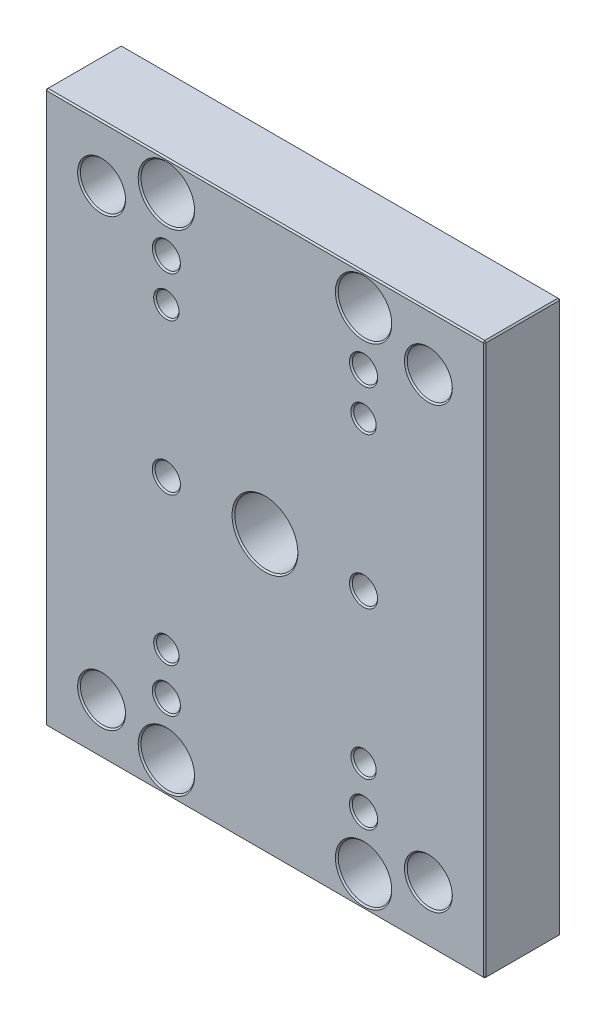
ISO-10303-21;
HEADER;
FILE_DESCRIPTION(('STEP AP214'),'2;1');
FILE_NAME('part.step','',(''),(''),'','','');
FILE_SCHEMA(('AUTOMOTIVE_DESIGN { 1 0 10303 214 1 1 1 1 }'));
ENDSEC;
DATA;
#1=APPLICATION_CONTEXT('core data for automotive mechanical design processes');
#2=APPLICATION_PROTOCOL_DEFINITION('international standard','automotive_design',2000,#1);
#3=PRODUCT_CONTEXT('',#1,'mechanical');
#4=PRODUCT('Part','Part','',(#3));
#5=PRODUCT_RELATED_PRODUCT_CATEGORY('part','',(#4));
#6=PRODUCT_DEFINITION_FORMATION('','',#4);
#7=PRODUCT_DEFINITION_CONTEXT('part definition',#1,'design');
#8=PRODUCT_DEFINITION('design','',#6,#7);
#9=PRODUCT_DEFINITION_SHAPE('','',#8);
#10=(LENGTH_UNIT() NAMED_UNIT(*) SI_UNIT(.MILLI.,.METRE.));
#11=(NAMED_UNIT(*) PLANE_ANGLE_UNIT() SI_UNIT($,.RADIAN.));
#12=(NAMED_UNIT(*) SI_UNIT($,.STERADIAN.) SOLID_ANGLE_UNIT());
#13=UNCERTAINTY_MEASURE_WITH_UNIT(LENGTH_MEASURE(1.E-05),#10,'distance_accuracy_value','');
#14=(GEOMETRIC_REPRESENTATION_CONTEXT(3) GLOBAL_UNCERTAINTY_ASSIGNED_CONTEXT((#13)) GLOBAL_UNIT_ASSIGNED_CONTEXT((#10,
#11,#12)) REPRESENTATION_CONTEXT('',''));
#15=CARTESIAN_POINT('',(0.,0.,0.));
#16=DIRECTION('',(0.,0.,1.));
#17=DIRECTION('',(1.,0.,0.));
#18=AXIS2_PLACEMENT_3D('',#15,#16,#17);
#19=CARTESIAN_POINT('',(19.9999999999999,18.,3.));
#20=DIRECTION('',(0.,0.,-1.));
#21=DIRECTION('',(-1.,0.,0.));
#22=AXIS2_PLACEMENT_3D('',#19,#20,#21);
#23=CYLINDRICAL_SURFACE('',#22,12.);
#24=CARTESIAN_POINT('',(19.9999999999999,18.,0.500000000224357));
#25=DIRECTION('',(0.,0.,-1.));
#26=DIRECTION('',(1.,0.,0.));
#27=AXIS2_PLACEMENT_3D('',#24,#25,#26);
#28=CIRCLE('',#27,12.0000000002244);
#29=CARTESIAN_POINT('',(32.0000000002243,18.,0.500000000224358));
#30=VERTEX_POINT('',#29);
#31=EDGE_CURVE('E189',#30,#30,#28,.T.);
#32=ORIENTED_EDGE('',*,*,#31,.T.);
#33=EDGE_LOOP('',(#32));
#34=FACE_BOUND('',#33,.T.);
#35=CARTESIAN_POINT('',(19.9999999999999,18.,6.));
#36=DIRECTION('',(0.,0.,-1.));
#37=DIRECTION('',(-1.,0.,0.));
#38=AXIS2_PLACEMENT_3D('',#35,#36,#37);
#39=CIRCLE('',#38,12.);
#40=CARTESIAN_POINT('',(7.99999999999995,18.,6.));
#41=VERTEX_POINT('',#40);
#42=EDGE_CURVE('E20',#41,#41,#39,.T.);
#43=ORIENTED_EDGE('',*,*,#42,.F.);
#44=EDGE_LOOP('',(#43));
#45=FACE_BOUND('',#44,.T.);
#46=ADVANCED_FACE('F17',(#34,#45),#23,.F.);
#47=CARTESIAN_POINT('',(136.,176.,3.));
#48=DIRECTION('',(0.,0.,-1.));
#49=DIRECTION('',(-1.,0.,0.));
#50=AXIS2_PLACEMENT_3D('',#47,#48,#49);
#51=CYLINDRICAL_SURFACE('',#50,12.);
#52=CARTESIAN_POINT('',(136.,176.,0.500000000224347));
#53=DIRECTION('',(0.,0.,-1.));
#54=DIRECTION('',(1.,0.,0.));
#55=AXIS2_PLACEMENT_3D('',#52,#53,#54);
#56=CIRCLE('',#55,12.0000000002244);
#57=CARTESIAN_POINT('',(148.000000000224,176.,0.500000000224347));
#58=VERTEX_POINT('',#57);
#59=EDGE_CURVE('E184',#58,#58,#56,.T.);
#60=ORIENTED_EDGE('',*,*,#59,.T.);
#61=EDGE_LOOP('',(#60));
#62=FACE_BOUND('',#61,.T.);
#63=CARTESIAN_POINT('',(136.,176.,6.));
#64=DIRECTION('',(0.,0.,-1.));
#65=DIRECTION('',(-1.,0.,0.));
#66=AXIS2_PLACEMENT_3D('',#63,#64,#65);
#67=CIRCLE('',#66,12.);
#68=CARTESIAN_POINT('',(124.,176.,6.));
#69=VERTEX_POINT('',#68);
#70=EDGE_CURVE('E361',#69,#69,#67,.T.);
#71=ORIENTED_EDGE('',*,*,#70,.F.);
#72=EDGE_LOOP('',(#71));
#73=FACE_BOUND('',#72,.T.);
#74=ADVANCED_FACE('F371',(#62,#73),#51,.F.);
#75=CARTESIAN_POINT('',(19.9999999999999,176.,3.));
#76=DIRECTION('',(0.,0.,-1.));
#77=DIRECTION('',(-1.,0.,0.));
#78=AXIS2_PLACEMENT_3D('',#75,#76,#77);
#79=CYLINDRICAL_SURFACE('',#78,12.);
#80=CARTESIAN_POINT('',(19.9999999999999,176.,0.500000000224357));
#81=DIRECTION('',(0.,0.,-1.));
#82=DIRECTION('',(1.,0.,0.));
#83=AXIS2_PLACEMENT_3D('',#80,#81,#82);
#84=CIRCLE('',#83,12.0000000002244);
#85=CARTESIAN_POINT('',(32.0000000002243,176.,0.500000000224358));
#86=VERTEX_POINT('',#85);
#87=EDGE_CURVE('E179',#86,#86,#84,.T.);
#88=ORIENTED_EDGE('',*,*,#87,.T.);
#89=EDGE_LOOP('',(#88));
#90=FACE_BOUND('',#89,.T.);
#91=CARTESIAN_POINT('',(19.9999999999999,176.,6.));
#92=DIRECTION('',(0.,0.,-1.));
#93=DIRECTION('',(-1.,0.,0.));
#94=AXIS2_PLACEMENT_3D('',#91,#92,#93);
#95=CIRCLE('',#94,12.);
#96=CARTESIAN_POINT('',(7.99999999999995,176.,6.));
#97=VERTEX_POINT('',#96);
#98=EDGE_CURVE('E359',#97,#97,#95,.T.);
#99=ORIENTED_EDGE('',*,*,#98,.F.);
#100=EDGE_LOOP('',(#99));
#101=FACE_BOUND('',#100,.T.);
#102=ADVANCED_FACE('F377',(#90,#101),#79,.F.);
#103=CARTESIAN_POINT('',(136.,20.,3.));
#104=DIRECTION('',(0.,0.,-1.));
#105=DIRECTION('',(-1.,0.,0.));
#106=AXIS2_PLACEMENT_3D('',#103,#104,#105);
#107=CYLINDRICAL_SURFACE('',#106,12.);
#108=CARTESIAN_POINT('',(136.,20.,0.500000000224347));
#109=DIRECTION('',(0.,0.,-1.));
#110=DIRECTION('',(1.,0.,0.));
#111=AXIS2_PLACEMENT_3D('',#108,#109,#110);
#112=CIRCLE('',#111,12.0000000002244);
#113=CARTESIAN_POINT('',(148.000000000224,20.,0.500000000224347));
#114=VERTEX_POINT('',#113);
#115=EDGE_CURVE('E174',#114,#114,#112,.T.);
#116=ORIENTED_EDGE('',*,*,#115,.T.);
#117=EDGE_LOOP('',(#116));
#118=FACE_BOUND('',#117,.T.);
#119=CARTESIAN_POINT('',(136.,20.,6.));
#120=DIRECTION('',(0.,0.,-1.));
#121=DIRECTION('',(-1.,0.,0.));
#122=AXIS2_PLACEMENT_3D('',#119,#120,#121);
#123=CIRCLE('',#122,12.);
#124=CARTESIAN_POINT('',(124.,20.,6.));
#125=VERTEX_POINT('',#124);
#126=EDGE_CURVE('E356',#125,#125,#123,.T.);
#127=ORIENTED_EDGE('',*,*,#126,.F.);
#128=EDGE_LOOP('',(#127));
#129=FACE_BOUND('',#128,.T.);
#130=ADVANCED_FACE('F809',(#118,#129),#107,.F.);
#131=CARTESIAN_POINT('',(113.,30.,4.5));
#132=DIRECTION('',(0.,0.,-1.));
#133=DIRECTION('',(-1.,0.,0.));
#134=AXIS2_PLACEMENT_3D('',#131,#132,#133);
#135=CYLINDRICAL_SURFACE('',#134,7.5);
#136=CARTESIAN_POINT('',(113.,30.,0.500000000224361));
#137=DIRECTION('',(0.,0.,-1.));
#138=DIRECTION('',(1.,0.,0.));
#139=AXIS2_PLACEMENT_3D('',#136,#137,#138);
#140=CIRCLE('',#139,7.50000000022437);
#141=CARTESIAN_POINT('',(120.500000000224,30.,0.500000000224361));
#142=VERTEX_POINT('',#141);
#143=EDGE_CURVE('E169',#142,#142,#140,.T.);
#144=ORIENTED_EDGE('',*,*,#143,.T.);
#145=EDGE_LOOP('',(#144));
#146=FACE_BOUND('',#145,.T.);
#147=CARTESIAN_POINT('',(113.,30.,9.));
#148=DIRECTION('',(0.,0.,-1.));
#149=DIRECTION('',(-1.,0.,0.));
#150=AXIS2_PLACEMENT_3D('',#147,#148,#149);
#151=CIRCLE('',#150,7.5);
#152=CARTESIAN_POINT('',(105.5,30.,9.));
#153=VERTEX_POINT('',#152);
#154=EDGE_CURVE('E353',#153,#153,#151,.T.);
#155=ORIENTED_EDGE('',*,*,#154,.F.);
#156=EDGE_LOOP('',(#155));
#157=FACE_BOUND('',#156,.T.);
#158=ADVANCED_FACE('F805',(#146,#157),#135,.F.);
#159=CARTESIAN_POINT('',(113.,166.,4.5));
#160=DIRECTION('',(0.,0.,-1.));
#161=DIRECTION('',(-1.,0.,0.));
#162=AXIS2_PLACEMENT_3D('',#159,#160,#161);
#163=CYLINDRICAL_SURFACE('',#162,7.5);
#164=CARTESIAN_POINT('',(113.,166.,0.500000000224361));
#165=DIRECTION('',(0.,0.,-1.));
#166=DIRECTION('',(1.,0.,0.));
#167=AXIS2_PLACEMENT_3D('',#164,#165,#166);
#168=CIRCLE('',#167,7.50000000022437);
#169=CARTESIAN_POINT('',(120.500000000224,166.,0.500000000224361));
#170=VERTEX_POINT('',#169);
#171=EDGE_CURVE('E164',#170,#170,#168,.T.);
#172=ORIENTED_EDGE('',*,*,#171,.T.);
#173=EDGE_LOOP('',(#172));
#174=FACE_BOUND('',#173,.T.);
#175=CARTESIAN_POINT('',(113.,166.,9.));
#176=DIRECTION('',(0.,0.,-1.));
#177=DIRECTION('',(-1.,0.,0.));
#178=AXIS2_PLACEMENT_3D('',#175,#176,#177);
#179=CIRCLE('',#178,7.5);
#180=CARTESIAN_POINT('',(105.5,166.,9.));
#181=VERTEX_POINT('',#180);
#182=EDGE_CURVE('E350',#181,#181,#179,.T.);
#183=ORIENTED_EDGE('',*,*,#182,.F.);
#184=EDGE_LOOP('',(#183));
#185=FACE_BOUND('',#184,.T.);
#186=ADVANCED_FACE('F801',(#174,#185),#163,.F.);
#187=CARTESIAN_POINT('',(43.,98.,4.5));
#188=DIRECTION('',(0.,0.,-1.));
#189=DIRECTION('',(-1.,0.,0.));
#190=AXIS2_PLACEMENT_3D('',#187,#188,#189);
#191=CYLINDRICAL_SURFACE('',#190,7.5);
#192=CARTESIAN_POINT('',(43.,98.,0.500000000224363));
#193=DIRECTION('',(0.,0.,-1.));
#194=DIRECTION('',(1.,0.,0.));
#195=AXIS2_PLACEMENT_3D('',#192,#193,#194);
#196=CIRCLE('',#195,7.50000000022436);
#197=CARTESIAN_POINT('',(50.5000000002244,98.,0.500000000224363));
#198=VERTEX_POINT('',#197);
#199=EDGE_CURVE('E159',#198,#198,#196,.T.);
#200=ORIENTED_EDGE('',*,*,#199,.T.);
#201=EDGE_LOOP('',(#200));
#202=FACE_BOUND('',#201,.T.);
#203=CARTESIAN_POINT('',(43.,98.,9.));
#204=DIRECTION('',(0.,0.,-1.));
#205=DIRECTION('',(-1.,0.,0.));
#206=AXIS2_PLACEMENT_3D('',#203,#204,#205);
#207=CIRCLE('',#206,7.5);
#208=CARTESIAN_POINT('',(35.5,98.,9.));
#209=VERTEX_POINT('',#208);
#210=EDGE_CURVE('E347',#209,#209,#207,.T.);
#211=ORIENTED_EDGE('',*,*,#210,.F.);
#212=EDGE_LOOP('',(#211));
#213=FACE_BOUND('',#212,.T.);
#214=ADVANCED_FACE('F797',(#202,#213),#191,.F.);
#215=CARTESIAN_POINT('',(43.,30.,4.5));
#216=DIRECTION('',(0.,0.,-1.));
#217=DIRECTION('',(-1.,0.,0.));
#218=AXIS2_PLACEMENT_3D('',#215,#216,#217);
#219=CYLINDRICAL_SURFACE('',#218,7.5);
#220=CARTESIAN_POINT('',(43.,30.,0.500000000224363));
#221=DIRECTION('',(0.,0.,-1.));
#222=DIRECTION('',(1.,0.,0.));
#223=AXIS2_PLACEMENT_3D('',#220,#221,#222);
#224=CIRCLE('',#223,7.50000000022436);
#225=CARTESIAN_POINT('',(50.5000000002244,30.,0.500000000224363));
#226=VERTEX_POINT('',#225);
#227=EDGE_CURVE('E154',#226,#226,#224,.T.);
#228=ORIENTED_EDGE('',*,*,#227,.T.);
#229=EDGE_LOOP('',(#228));
#230=FACE_BOUND('',#229,.T.);
#231=CARTESIAN_POINT('',(43.,30.,9.));
#232=DIRECTION('',(0.,0.,-1.));
#233=DIRECTION('',(-1.,0.,0.));
#234=AXIS2_PLACEMENT_3D('',#231,#232,#233);
#235=CIRCLE('',#234,7.5);
#236=CARTESIAN_POINT('',(35.5,30.,9.));
#237=VERTEX_POINT('',#236);
#238=EDGE_CURVE('E344',#237,#237,#235,.T.);
#239=ORIENTED_EDGE('',*,*,#238,.F.);
#240=EDGE_LOOP('',(#239));
#241=FACE_BOUND('',#240,.T.);
#242=ADVANCED_FACE('F793',(#230,#241),#219,.F.);
#243=CARTESIAN_POINT('',(43.,166.,4.5));
#244=DIRECTION('',(0.,0.,-1.));
#245=DIRECTION('',(-1.,0.,0.));
#246=AXIS2_PLACEMENT_3D('',#243,#244,#245);
#247=CYLINDRICAL_SURFACE('',#246,7.5);
#248=CARTESIAN_POINT('',(43.,166.,0.500000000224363));
#249=DIRECTION('',(0.,0.,-1.));
#250=DIRECTION('',(1.,0.,0.));
#251=AXIS2_PLACEMENT_3D('',#248,#249,#250);
#252=CIRCLE('',#251,7.50000000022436);
#253=CARTESIAN_POINT('',(50.5000000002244,166.,0.500000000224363));
#254=VERTEX_POINT('',#253);
#255=EDGE_CURVE('E149',#254,#254,#252,.T.);
#256=ORIENTED_EDGE('',*,*,#255,.T.);
#257=EDGE_LOOP('',(#256));
#258=FACE_BOUND('',#257,.T.);
#259=CARTESIAN_POINT('',(43.,166.,9.));
#260=DIRECTION('',(0.,0.,-1.));
#261=DIRECTION('',(-1.,0.,0.));
#262=AXIS2_PLACEMENT_3D('',#259,#260,#261);
#263=CIRCLE('',#262,7.5);
#264=CARTESIAN_POINT('',(35.5,166.,9.));
#265=VERTEX_POINT('',#264);
#266=EDGE_CURVE('E341',#265,#265,#263,.T.);
#267=ORIENTED_EDGE('',*,*,#266,.F.);
#268=EDGE_LOOP('',(#267));
#269=FACE_BOUND('',#268,.T.);
#270=ADVANCED_FACE('F789',(#258,#269),#247,.F.);
#271=CARTESIAN_POINT('',(113.,98.,4.5));
#272=DIRECTION('',(0.,0.,-1.));
#273=DIRECTION('',(-1.,0.,0.));
#274=AXIS2_PLACEMENT_3D('',#271,#272,#273);
#275=CYLINDRICAL_SURFACE('',#274,7.5);
#276=CARTESIAN_POINT('',(113.,98.,0.500000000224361));
#277=DIRECTION('',(0.,0.,-1.));
#278=DIRECTION('',(1.,0.,0.));
#279=AXIS2_PLACEMENT_3D('',#276,#277,#278);
#280=CIRCLE('',#279,7.50000000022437);
#281=CARTESIAN_POINT('',(120.500000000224,98.,0.500000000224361));
#282=VERTEX_POINT('',#281);
#283=EDGE_CURVE('E146',#282,#282,#280,.T.);
#284=ORIENTED_EDGE('',*,*,#283,.T.);
#285=EDGE_LOOP('',(#284));
#286=FACE_BOUND('',#285,.T.);
#287=CARTESIAN_POINT('',(113.,98.,9.));
#288=DIRECTION('',(0.,0.,-1.));
#289=DIRECTION('',(-1.,0.,0.));
#290=AXIS2_PLACEMENT_3D('',#287,#288,#289);
#291=CIRCLE('',#290,7.5);
#292=CARTESIAN_POINT('',(105.5,98.,9.));
#293=VERTEX_POINT('',#292);
#294=EDGE_CURVE('E338',#293,#293,#291,.T.);
#295=ORIENTED_EDGE('',*,*,#294,.F.);
#296=EDGE_LOOP('',(#295));
#297=FACE_BOUND('',#296,.T.);
#298=ADVANCED_FACE('F785',(#286,#297),#275,.F.);
#299=CARTESIAN_POINT('',(19.9999999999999,18.,-2.24363821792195E-10));
#300=DIRECTION('',(0.,0.,-1.));
#301=DIRECTION('',(-1.,0.,0.));
#302=AXIS2_PLACEMENT_3D('',#299,#300,#301);
#303=CONICAL_SURFACE('',#302,12.4999999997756,0.785398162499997);
#304=CARTESIAN_POINT('',(19.9999999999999,18.,-2.24365014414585E-10));
#305=DIRECTION('',(0.,0.,-1.));
#306=DIRECTION('',(-1.,0.,0.));
#307=AXIS2_PLACEMENT_3D('',#304,#305,#306);
#308=CIRCLE('',#307,12.4999999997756);
#309=CARTESIAN_POINT('',(7.50000000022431,18.,-2.24365014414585E-10));
#310=VERTEX_POINT('',#309);
#311=EDGE_CURVE('E335',#310,#310,#308,.T.);
#312=ORIENTED_EDGE('',*,*,#311,.T.);
#313=EDGE_LOOP('',(#312));
#314=FACE_BOUND('',#313,.T.);
#315=ORIENTED_EDGE('',*,*,#31,.F.);
#316=EDGE_LOOP('',(#315));
#317=FACE_BOUND('',#316,.T.);
#318=ADVANCED_FACE('F781',(#314,#317),#303,.F.);
#319=CARTESIAN_POINT('',(136.,176.,-2.24373145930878E-10));
#320=DIRECTION('',(0.,0.,-1.));
#321=DIRECTION('',(-1.,0.,0.));
#322=AXIS2_PLACEMENT_3D('',#319,#320,#321);
#323=CONICAL_SURFACE('',#322,12.4999999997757,0.785398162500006);
#324=CARTESIAN_POINT('',(136.,176.,-2.2437504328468E-10));
#325=DIRECTION('',(0.,0.,-1.));
#326=DIRECTION('',(-1.,0.,0.));
#327=AXIS2_PLACEMENT_3D('',#324,#325,#326);
#328=CIRCLE('',#327,12.4999999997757);
#329=CARTESIAN_POINT('',(123.500000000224,176.,-2.2437504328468E-10));
#330=VERTEX_POINT('',#329);
#331=EDGE_CURVE('E332',#330,#330,#328,.T.);
#332=ORIENTED_EDGE('',*,*,#331,.T.);
#333=EDGE_LOOP('',(#332));
#334=FACE_BOUND('',#333,.T.);
#335=ORIENTED_EDGE('',*,*,#59,.F.);
#336=EDGE_LOOP('',(#335));
#337=FACE_BOUND('',#336,.T.);
#338=ADVANCED_FACE('F777',(#334,#337),#323,.F.);
#339=CARTESIAN_POINT('',(19.9999999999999,176.,-2.24363821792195E-10));
#340=DIRECTION('',(0.,0.,-1.));
#341=DIRECTION('',(-1.,0.,0.));
#342=AXIS2_PLACEMENT_3D('',#339,#340,#341);
#343=CONICAL_SURFACE('',#342,12.4999999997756,0.785398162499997);
#344=CARTESIAN_POINT('',(19.9999999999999,176.,-2.24365014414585E-10));
#345=DIRECTION('',(0.,0.,-1.));
#346=DIRECTION('',(-1.,0.,0.));
#347=AXIS2_PLACEMENT_3D('',#344,#345,#346);
#348=CIRCLE('',#347,12.4999999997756);
#349=CARTESIAN_POINT('',(7.50000000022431,176.,-2.24365014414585E-10));
#350=VERTEX_POINT('',#349);
#351=EDGE_CURVE('E329',#350,#350,#348,.T.);
#352=ORIENTED_EDGE('',*,*,#351,.T.);
#353=EDGE_LOOP('',(#352));
#354=FACE_BOUND('',#353,.T.);
#355=ORIENTED_EDGE('',*,*,#87,.F.);
#356=EDGE_LOOP('',(#355));
#357=FACE_BOUND('',#356,.T.);
#358=ADVANCED_FACE('F773',(#354,#357),#343,.F.);
#359=CARTESIAN_POINT('',(136.,20.,-2.24373145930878E-10));
#360=DIRECTION('',(0.,0.,-1.));
#361=DIRECTION('',(-1.,0.,0.));
#362=AXIS2_PLACEMENT_3D('',#359,#360,#361);
#363=CONICAL_SURFACE('',#362,12.4999999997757,0.785398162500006);
#364=CARTESIAN_POINT('',(136.,20.,-2.2437504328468E-10));
#365=DIRECTION('',(0.,0.,-1.));
#366=DIRECTION('',(-1.,0.,0.));
#367=AXIS2_PLACEMENT_3D('',#364,#365,#366);
#368=CIRCLE('',#367,12.4999999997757);
#369=CARTESIAN_POINT('',(123.500000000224,20.,-2.2437504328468E-10));
#370=VERTEX_POINT('',#369);
#371=EDGE_CURVE('E326',#370,#370,#368,.T.);
#372=ORIENTED_EDGE('',*,*,#371,.T.);
#373=EDGE_LOOP('',(#372));
#374=FACE_BOUND('',#373,.T.);
#375=ORIENTED_EDGE('',*,*,#115,.F.);
#376=EDGE_LOOP('',(#375));
#377=FACE_BOUND('',#376,.T.);
#378=ADVANCED_FACE('F769',(#374,#377),#363,.F.);
#379=CARTESIAN_POINT('',(113.,30.,-2.24359268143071E-10));
#380=DIRECTION('',(0.,0.,-1.));
#381=DIRECTION('',(-1.,0.,0.));
#382=AXIS2_PLACEMENT_3D('',#379,#380,#381);
#383=CONICAL_SURFACE('',#382,7.99999999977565,0.785398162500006);
#384=CARTESIAN_POINT('',(113.,30.,-2.24361165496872E-10));
#385=DIRECTION('',(0.,0.,-1.));
#386=DIRECTION('',(-1.,0.,0.));
#387=AXIS2_PLACEMENT_3D('',#384,#385,#386);
#388=CIRCLE('',#387,7.99999999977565);
#389=CARTESIAN_POINT('',(105.000000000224,30.,-2.24361165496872E-10));
#390=VERTEX_POINT('',#389);
#391=EDGE_CURVE('E323',#390,#390,#388,.T.);
#392=ORIENTED_EDGE('',*,*,#391,.T.);
#393=EDGE_LOOP('',(#392));
#394=FACE_BOUND('',#393,.T.);
#395=ORIENTED_EDGE('',*,*,#143,.F.);
#396=EDGE_LOOP('',(#395));
#397=FACE_BOUND('',#396,.T.);
#398=ADVANCED_FACE('F765',(#394,#397),#383,.F.);
#399=CARTESIAN_POINT('',(113.,166.,-2.24359268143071E-10));
#400=DIRECTION('',(0.,0.,-1.));
#401=DIRECTION('',(-1.,0.,0.));
#402=AXIS2_PLACEMENT_3D('',#399,#400,#401);
#403=CONICAL_SURFACE('',#402,7.99999999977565,0.785398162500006);
#404=CARTESIAN_POINT('',(113.,166.,-2.24361165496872E-10));
#405=DIRECTION('',(0.,0.,-1.));
#406=DIRECTION('',(-1.,0.,0.));
#407=AXIS2_PLACEMENT_3D('',#404,#405,#406);
#408=CIRCLE('',#407,7.99999999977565);
#409=CARTESIAN_POINT('',(105.000000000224,166.,-2.24361165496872E-10));
#410=VERTEX_POINT('',#409);
#411=EDGE_CURVE('E320',#410,#410,#408,.T.);
#412=ORIENTED_EDGE('',*,*,#411,.T.);
#413=EDGE_LOOP('',(#412));
#414=FACE_BOUND('',#413,.T.);
#415=ORIENTED_EDGE('',*,*,#171,.F.);
#416=EDGE_LOOP('',(#415));
#417=FACE_BOUND('',#416,.T.);
#418=ADVANCED_FACE('F761',(#414,#417),#403,.F.);
#419=CARTESIAN_POINT('',(43.,98.,-2.24362900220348E-10));
#420=DIRECTION('',(0.,0.,-1.));
#421=DIRECTION('',(-1.,0.,0.));
#422=AXIS2_PLACEMENT_3D('',#419,#420,#421);
#423=CONICAL_SURFACE('',#422,7.99999999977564,0.785398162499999);
#424=CARTESIAN_POINT('',(43.,98.,-2.24362737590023E-10));
#425=DIRECTION('',(0.,0.,-1.));
#426=DIRECTION('',(-1.,0.,0.));
#427=AXIS2_PLACEMENT_3D('',#424,#425,#426);
#428=CIRCLE('',#427,7.99999999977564);
#429=CARTESIAN_POINT('',(35.0000000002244,98.,-2.24362737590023E-10));
#430=VERTEX_POINT('',#429);
#431=EDGE_CURVE('E317',#430,#430,#428,.T.);
#432=ORIENTED_EDGE('',*,*,#431,.T.);
#433=EDGE_LOOP('',(#432));
#434=FACE_BOUND('',#433,.T.);
#435=ORIENTED_EDGE('',*,*,#199,.F.);
#436=EDGE_LOOP('',(#435));
#437=FACE_BOUND('',#436,.T.);
#438=ADVANCED_FACE('F757',(#434,#437),#423,.F.);
#439=CARTESIAN_POINT('',(43.,30.,-2.24362900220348E-10));
#440=DIRECTION('',(0.,0.,-1.));
#441=DIRECTION('',(-1.,0.,0.));
#442=AXIS2_PLACEMENT_3D('',#439,#440,#441);
#443=CONICAL_SURFACE('',#442,7.99999999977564,0.785398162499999);
#444=CARTESIAN_POINT('',(43.,30.,-2.24362737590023E-10));
#445=DIRECTION('',(0.,0.,-1.));
#446=DIRECTION('',(-1.,0.,0.));
#447=AXIS2_PLACEMENT_3D('',#444,#445,#446);
#448=CIRCLE('',#447,7.99999999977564);
#449=CARTESIAN_POINT('',(35.0000000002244,30.,-2.24362737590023E-10));
#450=VERTEX_POINT('',#449);
#451=EDGE_CURVE('E314',#450,#450,#448,.T.);
#452=ORIENTED_EDGE('',*,*,#451,.T.);
#453=EDGE_LOOP('',(#452));
#454=FACE_BOUND('',#453,.T.);
#455=ORIENTED_EDGE('',*,*,#227,.F.);
#456=EDGE_LOOP('',(#455));
#457=FACE_BOUND('',#456,.T.);
#458=ADVANCED_FACE('F753',(#454,#457),#443,.F.);
#459=CARTESIAN_POINT('',(43.,166.,-2.24362900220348E-10));
#460=DIRECTION('',(0.,0.,-1.));
#461=DIRECTION('',(-1.,0.,0.));
#462=AXIS2_PLACEMENT_3D('',#459,#460,#461);
#463=CONICAL_SURFACE('',#462,7.99999999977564,0.785398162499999);
#464=CARTESIAN_POINT('',(43.,166.,-2.24362737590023E-10));
#465=DIRECTION('',(0.,0.,-1.));
#466=DIRECTION('',(-1.,0.,0.));
#467=AXIS2_PLACEMENT_3D('',#464,#465,#466);
#468=CIRCLE('',#467,7.99999999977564);
#469=CARTESIAN_POINT('',(35.0000000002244,166.,-2.24362737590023E-10));
#470=VERTEX_POINT('',#469);
#471=EDGE_CURVE('E311',#470,#470,#468,.T.);
#472=ORIENTED_EDGE('',*,*,#471,.T.);
#473=EDGE_LOOP('',(#472));
#474=FACE_BOUND('',#473,.T.);
#475=ORIENTED_EDGE('',*,*,#255,.F.);
#476=EDGE_LOOP('',(#475));
#477=FACE_BOUND('',#476,.T.);
#478=ADVANCED_FACE('F749',(#474,#477),#463,.F.);
#479=CARTESIAN_POINT('',(113.,98.,-2.24359268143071E-10));
#480=DIRECTION('',(0.,0.,-1.));
#481=DIRECTION('',(-1.,0.,0.));
#482=AXIS2_PLACEMENT_3D('',#479,#480,#481);
#483=CONICAL_SURFACE('',#482,7.99999999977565,0.785398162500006);
#484=CARTESIAN_POINT('',(113.,98.,-2.24361165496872E-10));
#485=DIRECTION('',(0.,0.,-1.));
#486=DIRECTION('',(-1.,0.,0.));
#487=AXIS2_PLACEMENT_3D('',#484,#485,#486);
#488=CIRCLE('',#487,7.99999999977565);
#489=CARTESIAN_POINT('',(105.000000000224,98.,-2.24361165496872E-10));
#490=VERTEX_POINT('',#489);
#491=EDGE_CURVE('E120',#490,#490,#488,.T.);
#492=ORIENTED_EDGE('',*,*,#491,.T.);
#493=EDGE_LOOP('',(#492));
#494=FACE_BOUND('',#493,.T.);
#495=ORIENTED_EDGE('',*,*,#283,.F.);
#496=EDGE_LOOP('',(#495));
#497=FACE_BOUND('',#496,.T.);
#498=ADVANCED_FACE('F746',(#494,#497),#483,.F.);
#499=CARTESIAN_POINT('',(155.5,0.250000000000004,0.25));
#500=DIRECTION('',(0.577350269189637,-0.577350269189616,-0.577350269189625));
#501=DIRECTION('',(-0.70710678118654,0.,-0.707106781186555));
#502=AXIS2_PLACEMENT_3D('',#499,#500,#501);
#503=PLANE('',#502);
#504=DIRECTION('',(0.707106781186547,0.707106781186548,0.));
#505=VECTOR('',#504,1.);
#506=CARTESIAN_POINT('',(155.75,0.250000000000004,0.5));
#507=LINE('',#506,#505);
#508=CARTESIAN_POINT('',(155.5,0.,0.5));
#509=VERTEX_POINT('',#508);
#510=CARTESIAN_POINT('',(156.,0.500000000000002,0.500000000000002));
#511=VERTEX_POINT('',#510);
#512=EDGE_CURVE('E115',#509,#511,#507,.T.);
#513=ORIENTED_EDGE('',*,*,#512,.F.);
#514=DIRECTION('',(0.,0.707106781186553,-0.707106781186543));
#515=VECTOR('',#514,1.);
#516=CARTESIAN_POINT('',(155.5,0.250000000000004,0.25));
#517=LINE('',#516,#515);
#518=CARTESIAN_POINT('',(155.5,0.500000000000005,0.));
#519=VERTEX_POINT('',#518);
#520=EDGE_CURVE('E110',#519,#509,#517,.F.);
#521=ORIENTED_EDGE('',*,*,#520,.F.);
#522=DIRECTION('',(-0.707106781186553,0.,-0.707106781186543));
#523=VECTOR('',#522,1.);
#524=CARTESIAN_POINT('',(155.75,0.5,0.249999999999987));
#525=LINE('',#524,#523);
#526=EDGE_CURVE('E113',#511,#519,#525,.T.);
#527=ORIENTED_EDGE('',*,*,#526,.F.);
#528=EDGE_LOOP('',(#513,#521,#527));
#529=FACE_BOUND('',#528,.T.);
#530=ADVANCED_FACE('F112',(#529),#503,.T.);
#531=CARTESIAN_POINT('',(155.5,195.5,0.));
#532=DIRECTION('',(0.577350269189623,0.577350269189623,-0.577350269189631));
#533=DIRECTION('',(-0.707106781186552,0.,-0.707106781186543));
#534=AXIS2_PLACEMENT_3D('',#531,#532,#533);
#535=PLANE('',#534);
#536=DIRECTION('',(-0.707106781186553,0.,-0.707106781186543));
#537=VECTOR('',#536,1.);
#538=CARTESIAN_POINT('',(155.75,195.5,0.250000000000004));
#539=LINE('',#538,#537);
#540=CARTESIAN_POINT('',(155.5,195.5,0.));
#541=VERTEX_POINT('',#540);
#542=CARTESIAN_POINT('',(156.,195.5,0.499999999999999));
#543=VERTEX_POINT('',#542);
#544=EDGE_CURVE('E131',#541,#543,#539,.F.);
#545=ORIENTED_EDGE('',*,*,#544,.F.);
#546=DIRECTION('',(0.,0.707106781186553,0.707106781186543));
#547=VECTOR('',#546,1.);
#548=CARTESIAN_POINT('',(155.5,195.75,0.25));
#549=LINE('',#548,#547);
#550=CARTESIAN_POINT('',(155.5,196.,0.499999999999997));
#551=VERTEX_POINT('',#550);
#552=EDGE_CURVE('E1391',#551,#541,#549,.F.);
#553=ORIENTED_EDGE('',*,*,#552,.F.);
#554=DIRECTION('',(-0.707106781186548,0.707106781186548,0.));
#555=VECTOR('',#554,1.);
#556=CARTESIAN_POINT('',(155.75,195.75,0.5));
#557=LINE('',#556,#555);
#558=EDGE_CURVE('E137',#543,#551,#557,.T.);
#559=ORIENTED_EDGE('',*,*,#558,.F.);
#560=EDGE_LOOP('',(#545,#553,#559));
#561=FACE_BOUND('',#560,.T.);
#562=ADVANCED_FACE('F739',(#561),#535,.T.);
#563=CARTESIAN_POINT('',(0.500000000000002,0.250000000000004,0.25));
#564=DIRECTION('',(-0.577350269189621,-0.577350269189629,-0.577350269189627));
#565=DIRECTION('',(0.,0.707106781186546,-0.707106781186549));
#566=AXIS2_PLACEMENT_3D('',#563,#564,#565);
#567=PLANE('',#566);
#568=DIRECTION('',(0.707106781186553,-0.707106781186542,0.));
#569=VECTOR('',#568,1.);
#570=CARTESIAN_POINT('',(0.250000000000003,0.25,0.5));
#571=LINE('',#570,#569);
#572=CARTESIAN_POINT('',(0.,0.500000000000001,0.5));
#573=VERTEX_POINT('',#572);
#574=CARTESIAN_POINT('',(0.500000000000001,0.,0.5));
#575=VERTEX_POINT('',#574);
#576=EDGE_CURVE('E1385',#573,#575,#571,.T.);
#577=ORIENTED_EDGE('',*,*,#576,.F.);
#578=DIRECTION('',(-0.707106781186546,0.,0.707106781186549));
#579=VECTOR('',#578,1.);
#580=CARTESIAN_POINT('',(0.249999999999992,0.500000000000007,0.250000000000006));
#581=LINE('',#580,#579);
#582=CARTESIAN_POINT('',(0.499999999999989,0.500000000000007,0.));
#583=VERTEX_POINT('',#582);
#584=EDGE_CURVE('E1379',#583,#573,#581,.T.);
#585=ORIENTED_EDGE('',*,*,#584,.F.);
#586=DIRECTION('',(0.,0.707106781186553,-0.707106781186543));
#587=VECTOR('',#586,1.);
#588=CARTESIAN_POINT('',(0.5,0.250000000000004,0.25));
#589=LINE('',#588,#587);
#590=EDGE_CURVE('E119',#575,#583,#589,.T.);
#591=ORIENTED_EDGE('',*,*,#590,.F.);
#592=EDGE_LOOP('',(#577,#585,#591));
#593=FACE_BOUND('',#592,.T.);
#594=ADVANCED_FACE('F735',(#593),#567,.T.);
#595=CARTESIAN_POINT('',(0.499999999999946,195.75,0.25));
#596=DIRECTION('',(-0.577350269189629,0.577350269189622,-0.577350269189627));
#597=DIRECTION('',(-0.707106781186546,0.,0.707106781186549));
#598=AXIS2_PLACEMENT_3D('',#595,#596,#597);
#599=PLANE('',#598);
#600=DIRECTION('',(-0.707106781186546,0.,0.707106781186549));
#601=VECTOR('',#600,1.);
#602=CARTESIAN_POINT('',(0.249999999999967,195.5,0.249999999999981));
#603=LINE('',#602,#601);
#604=CARTESIAN_POINT('',(0.,195.5,0.499999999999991));
#605=VERTEX_POINT('',#604);
#606=CARTESIAN_POINT('',(0.499999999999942,195.5,0.));
#607=VERTEX_POINT('',#606);
#608=EDGE_CURVE('E1376',#605,#607,#603,.F.);
#609=ORIENTED_EDGE('',*,*,#608,.F.);
#610=DIRECTION('',(-0.707106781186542,-0.707106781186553,0.));
#611=VECTOR('',#610,1.);
#612=CARTESIAN_POINT('',(0.249999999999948,195.75,0.5));
#613=LINE('',#612,#611);
#614=CARTESIAN_POINT('',(0.499999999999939,196.,0.499999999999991));
#615=VERTEX_POINT('',#614);
#616=EDGE_CURVE('E1382',#615,#605,#613,.T.);
#617=ORIENTED_EDGE('',*,*,#616,.F.);
#618=DIRECTION('',(0.,0.707106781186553,0.707106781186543));
#619=VECTOR('',#618,1.);
#620=CARTESIAN_POINT('',(0.499999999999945,195.75,0.25));
#621=LINE('',#620,#619);
#622=EDGE_CURVE('E1394',#607,#615,#621,.T.);
#623=ORIENTED_EDGE('',*,*,#622,.F.);
#624=EDGE_LOOP('',(#609,#617,#623));
#625=FACE_BOUND('',#624,.T.);
#626=ADVANCED_FACE('F731',(#625),#599,.T.);
#627=CARTESIAN_POINT('',(19.9999999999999,18.,6.));
#628=DIRECTION('',(0.,0.,-1.));
#629=DIRECTION('',(-1.,0.,0.));
#630=AXIS2_PLACEMENT_3D('',#627,#628,#629);
#631=PLANE('',#630);
#632=CARTESIAN_POINT('',(19.9999999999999,18.,5.99999999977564));
#633=DIRECTION('',(0.,0.,-1.));
#634=DIRECTION('',(-1.,0.,0.));
#635=AXIS2_PLACEMENT_3D('',#632,#633,#634);
#636=CIRCLE('',#635,8.49999999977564);
#637=CARTESIAN_POINT('',(11.5000000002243,18.,5.99999999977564));
#638=VERTEX_POINT('',#637);
#639=EDGE_CURVE('E293',#638,#638,#636,.F.);
#640=ORIENTED_EDGE('',*,*,#639,.T.);
#641=EDGE_LOOP('',(#640));
#642=FACE_BOUND('',#641,.T.);
#643=ORIENTED_EDGE('',*,*,#42,.T.);
#644=EDGE_LOOP('',(#643));
#645=FACE_BOUND('',#644,.T.);
#646=ADVANCED_FACE('F368',(#642,#645),#631,.T.);
#647=CARTESIAN_POINT('',(136.,176.,6.));
#648=DIRECTION('',(0.,0.,-1.));
#649=DIRECTION('',(-1.,0.,0.));
#650=AXIS2_PLACEMENT_3D('',#647,#648,#649);
#651=PLANE('',#650);
#652=CARTESIAN_POINT('',(136.,176.,5.99999999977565));
#653=DIRECTION('',(0.,0.,-1.));
#654=DIRECTION('',(0.,1.,0.));
#655=AXIS2_PLACEMENT_3D('',#652,#653,#654);
#656=CIRCLE('',#655,8.49999999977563);
#657=CARTESIAN_POINT('',(136.,184.499999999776,5.99999999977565));
#658=VERTEX_POINT('',#657);
#659=EDGE_CURVE('E290',#658,#658,#656,.F.);
#660=ORIENTED_EDGE('',*,*,#659,.T.);
#661=EDGE_LOOP('',(#660));
#662=FACE_BOUND('',#661,.T.);
#663=ORIENTED_EDGE('',*,*,#70,.T.);
#664=EDGE_LOOP('',(#663));
#665=FACE_BOUND('',#664,.T.);
#666=ADVANCED_FACE('F724',(#662,#665),#651,.T.);
#667=CARTESIAN_POINT('',(19.9999999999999,176.,6.));
#668=DIRECTION('',(0.,0.,-1.));
#669=DIRECTION('',(-1.,0.,0.));
#670=AXIS2_PLACEMENT_3D('',#667,#668,#669);
#671=PLANE('',#670);
#672=CARTESIAN_POINT('',(19.9999999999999,176.,5.99999999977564));
#673=DIRECTION('',(0.,0.,-1.));
#674=DIRECTION('',(-1.,0.,0.));
#675=AXIS2_PLACEMENT_3D('',#672,#673,#674);
#676=CIRCLE('',#675,8.49999999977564);
#677=CARTESIAN_POINT('',(11.5000000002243,176.,5.99999999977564));
#678=VERTEX_POINT('',#677);
#679=EDGE_CURVE('E287',#678,#678,#676,.F.);
#680=ORIENTED_EDGE('',*,*,#679,.T.);
#681=EDGE_LOOP('',(#680));
#682=FACE_BOUND('',#681,.T.);
#683=ORIENTED_EDGE('',*,*,#98,.T.);
#684=EDGE_LOOP('',(#683));
#685=FACE_BOUND('',#684,.T.);
#686=ADVANCED_FACE('F720',(#682,#685),#671,.T.);
#687=CARTESIAN_POINT('',(136.,20.,6.));
#688=DIRECTION('',(0.,0.,-1.));
#689=DIRECTION('',(-1.,0.,0.));
#690=AXIS2_PLACEMENT_3D('',#687,#688,#689);
#691=PLANE('',#690);
#692=CARTESIAN_POINT('',(136.,20.,5.99999999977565));
#693=DIRECTION('',(0.,0.,-1.));
#694=DIRECTION('',(0.,1.,0.));
#695=AXIS2_PLACEMENT_3D('',#692,#693,#694);
#696=CIRCLE('',#695,8.49999999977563);
#697=CARTESIAN_POINT('',(136.,28.4999999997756,5.99999999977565));
#698=VERTEX_POINT('',#697);
#699=EDGE_CURVE('E284',#698,#698,#696,.F.);
#700=ORIENTED_EDGE('',*,*,#699,.T.);
#701=EDGE_LOOP('',(#700));
#702=FACE_BOUND('',#701,.T.);
#703=ORIENTED_EDGE('',*,*,#126,.T.);
#704=EDGE_LOOP('',(#703));
#705=FACE_BOUND('',#704,.T.);
#706=ADVANCED_FACE('F716',(#702,#705),#691,.T.);
#707=CARTESIAN_POINT('',(113.,30.,9.));
#708=DIRECTION('',(0.,0.,-1.));
#709=DIRECTION('',(-1.,0.,0.));
#710=AXIS2_PLACEMENT_3D('',#707,#708,#709);
#711=PLANE('',#710);
#712=CARTESIAN_POINT('',(113.,30.,8.99999999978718));
#713=DIRECTION('',(0.,0.,-1.));
#714=DIRECTION('',(-1.,0.,0.));
#715=AXIS2_PLACEMENT_3D('',#712,#713,#714);
#716=CIRCLE('',#715,4.99999999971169);
#717=CARTESIAN_POINT('',(108.000000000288,30.,8.99999999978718));
#718=VERTEX_POINT('',#717);
#719=EDGE_CURVE('E278',#718,#718,#716,.F.);
#720=ORIENTED_EDGE('',*,*,#719,.T.);
#721=EDGE_LOOP('',(#720));
#722=FACE_BOUND('',#721,.T.);
#723=ORIENTED_EDGE('',*,*,#154,.T.);
#724=EDGE_LOOP('',(#723));
#725=FACE_BOUND('',#724,.T.);
#726=ADVANCED_FACE('F712',(#722,#725),#711,.T.);
#727=CARTESIAN_POINT('',(113.,166.,9.));
#728=DIRECTION('',(0.,0.,-1.));
#729=DIRECTION('',(-1.,0.,0.));
#730=AXIS2_PLACEMENT_3D('',#727,#728,#729);
#731=PLANE('',#730);
#732=CARTESIAN_POINT('',(113.,166.,8.99999999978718));
#733=DIRECTION('',(0.,0.,-1.));
#734=DIRECTION('',(-1.,0.,0.));
#735=AXIS2_PLACEMENT_3D('',#732,#733,#734);
#736=CIRCLE('',#735,4.99999999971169);
#737=CARTESIAN_POINT('',(108.000000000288,166.,8.99999999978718));
#738=VERTEX_POINT('',#737);
#739=EDGE_CURVE('E275',#738,#738,#736,.F.);
#740=ORIENTED_EDGE('',*,*,#739,.T.);
#741=EDGE_LOOP('',(#740));
#742=FACE_BOUND('',#741,.T.);
#743=ORIENTED_EDGE('',*,*,#182,.T.);
#744=EDGE_LOOP('',(#743));
#745=FACE_BOUND('',#744,.T.);
#746=ADVANCED_FACE('F708',(#742,#745),#731,.T.);
#747=CARTESIAN_POINT('',(43.,98.,9.));
#748=DIRECTION('',(0.,0.,-1.));
#749=DIRECTION('',(-1.,0.,0.));
#750=AXIS2_PLACEMENT_3D('',#747,#748,#749);
#751=PLANE('',#750);
#752=CARTESIAN_POINT('',(43.,98.,8.99999999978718));
#753=DIRECTION('',(0.,0.,-1.));
#754=DIRECTION('',(-1.,0.,0.));
#755=AXIS2_PLACEMENT_3D('',#752,#753,#754);
#756=CIRCLE('',#755,4.99999999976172);
#757=CARTESIAN_POINT('',(38.0000000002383,98.,8.99999999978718));
#758=VERTEX_POINT('',#757);
#759=EDGE_CURVE('E272',#758,#758,#756,.F.);
#760=ORIENTED_EDGE('',*,*,#759,.T.);
#761=EDGE_LOOP('',(#760));
#762=FACE_BOUND('',#761,.T.);
#763=ORIENTED_EDGE('',*,*,#210,.T.);
#764=EDGE_LOOP('',(#763));
#765=FACE_BOUND('',#764,.T.);
#766=ADVANCED_FACE('F704',(#762,#765),#751,.T.);
#767=CARTESIAN_POINT('',(43.,30.,9.));
#768=DIRECTION('',(0.,0.,-1.));
#769=DIRECTION('',(-1.,0.,0.));
#770=AXIS2_PLACEMENT_3D('',#767,#768,#769);
#771=PLANE('',#770);
#772=CARTESIAN_POINT('',(43.,30.,8.99999999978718));
#773=DIRECTION('',(0.,0.,-1.));
#774=DIRECTION('',(-1.,0.,0.));
#775=AXIS2_PLACEMENT_3D('',#772,#773,#774);
#776=CIRCLE('',#775,4.99999999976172);
#777=CARTESIAN_POINT('',(38.0000000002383,30.,8.99999999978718));
#778=VERTEX_POINT('',#777);
#779=EDGE_CURVE('E269',#778,#778,#776,.F.);
#780=ORIENTED_EDGE('',*,*,#779,.T.);
#781=EDGE_LOOP('',(#780));
#782=FACE_BOUND('',#781,.T.);
#783=ORIENTED_EDGE('',*,*,#238,.T.);
#784=EDGE_LOOP('',(#783));
#785=FACE_BOUND('',#784,.T.);
#786=ADVANCED_FACE('F700',(#782,#785),#771,.T.);
#787=CARTESIAN_POINT('',(43.,166.,9.));
#788=DIRECTION('',(0.,0.,-1.));
#789=DIRECTION('',(-1.,0.,0.));
#790=AXIS2_PLACEMENT_3D('',#787,#788,#789);
#791=PLANE('',#790);
#792=CARTESIAN_POINT('',(43.,166.,8.99999999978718));
#793=DIRECTION('',(0.,0.,-1.));
#794=DIRECTION('',(-1.,0.,0.));
#795=AXIS2_PLACEMENT_3D('',#792,#793,#794);
#796=CIRCLE('',#795,4.99999999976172);
#797=CARTESIAN_POINT('',(38.0000000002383,166.,8.99999999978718));
#798=VERTEX_POINT('',#797);
#799=EDGE_CURVE('E266',#798,#798,#796,.F.);
#800=ORIENTED_EDGE('',*,*,#799,.T.);
#801=EDGE_LOOP('',(#800));
#802=FACE_BOUND('',#801,.T.);
#803=ORIENTED_EDGE('',*,*,#266,.T.);
#804=EDGE_LOOP('',(#803));
#805=FACE_BOUND('',#804,.T.);
#806=ADVANCED_FACE('F696',(#802,#805),#791,.T.);
#807=CARTESIAN_POINT('',(113.,98.,9.));
#808=DIRECTION('',(0.,0.,-1.));
#809=DIRECTION('',(-1.,0.,0.));
#810=AXIS2_PLACEMENT_3D('',#807,#808,#809);
#811=PLANE('',#810);
#812=CARTESIAN_POINT('',(113.,98.,8.99999999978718));
#813=DIRECTION('',(0.,0.,-1.));
#814=DIRECTION('',(-1.,0.,0.));
#815=AXIS2_PLACEMENT_3D('',#812,#813,#814);
#816=CIRCLE('',#815,4.99999999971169);
#817=CARTESIAN_POINT('',(108.000000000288,98.,8.99999999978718));
#818=VERTEX_POINT('',#817);
#819=EDGE_CURVE('E263',#818,#818,#816,.F.);
#820=ORIENTED_EDGE('',*,*,#819,.T.);
#821=EDGE_LOOP('',(#820));
#822=FACE_BOUND('',#821,.T.);
#823=ORIENTED_EDGE('',*,*,#294,.T.);
#824=EDGE_LOOP('',(#823));
#825=FACE_BOUND('',#824,.T.);
#826=ADVANCED_FACE('F692',(#822,#825),#811,.T.);
#827=CARTESIAN_POINT('',(78.,98.,0.));
#828=DIRECTION('',(0.,0.,1.));
#829=DIRECTION('',(1.,0.,0.));
#830=AXIS2_PLACEMENT_3D('',#827,#828,#829);
#831=PLANE('',#830);
#832=CARTESIAN_POINT('',(113.,151.,-2.27373675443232E-10));
#833=DIRECTION('',(0.,0.,-1.));
#834=DIRECTION('',(-1.,0.,0.));
#835=AXIS2_PLACEMENT_3D('',#832,#833,#834);
#836=CIRCLE('',#835,4.49999999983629);
#837=CARTESIAN_POINT('',(108.500000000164,151.,-2.27373675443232E-10));
#838=VERTEX_POINT('',#837);
#839=EDGE_CURVE('E250',#838,#838,#836,.F.);
#840=ORIENTED_EDGE('',*,*,#839,.T.);
#841=EDGE_LOOP('',(#840));
#842=FACE_BOUND('',#841,.T.);
#843=CARTESIAN_POINT('',(43.,45.,-2.8421709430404E-10));
#844=DIRECTION('',(0.,0.,-1.));
#845=DIRECTION('',(-1.,0.,0.));
#846=AXIS2_PLACEMENT_3D('',#843,#844,#845);
#847=CIRCLE('',#846,4.49999999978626);
#848=CARTESIAN_POINT('',(38.5000000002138,45.,-2.8421709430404E-10));
#849=VERTEX_POINT('',#848);
#850=EDGE_CURVE('E254',#849,#849,#847,.F.);
#851=ORIENTED_EDGE('',*,*,#850,.T.);
#852=EDGE_LOOP('',(#851));
#853=FACE_BOUND('',#852,.T.);
#854=CARTESIAN_POINT('',(43.,151.,-2.8421709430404E-10));
#855=DIRECTION('',(0.,0.,-1.));
#856=DIRECTION('',(-1.,0.,0.));
#857=AXIS2_PLACEMENT_3D('',#854,#855,#856);
#858=CIRCLE('',#857,4.49999999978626);
#859=CARTESIAN_POINT('',(38.5000000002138,151.,-2.8421709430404E-10));
#860=VERTEX_POINT('',#859);
#861=EDGE_CURVE('E257',#860,#860,#858,.F.);
#862=ORIENTED_EDGE('',*,*,#861,.T.);
#863=EDGE_LOOP('',(#862));
#864=FACE_BOUND('',#863,.T.);
#865=CARTESIAN_POINT('',(113.,45.,-2.27373675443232E-10));
#866=DIRECTION('',(0.,0.,-1.));
#867=DIRECTION('',(-1.,0.,0.));
#868=AXIS2_PLACEMENT_3D('',#865,#866,#867);
#869=CIRCLE('',#868,4.49999999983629);
#870=CARTESIAN_POINT('',(108.500000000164,45.,-2.27373675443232E-10));
#871=VERTEX_POINT('',#870);
#872=EDGE_CURVE('E260',#871,#871,#869,.F.);
#873=ORIENTED_EDGE('',*,*,#872,.T.);
#874=EDGE_LOOP('',(#873));
#875=FACE_BOUND('',#874,.T.);
#876=ORIENTED_EDGE('',*,*,#491,.F.);
#877=EDGE_LOOP('',(#876));
#878=FACE_BOUND('',#877,.T.);
#879=ORIENTED_EDGE('',*,*,#471,.F.);
#880=EDGE_LOOP('',(#879));
#881=FACE_BOUND('',#880,.T.);
#882=ORIENTED_EDGE('',*,*,#451,.F.);
#883=EDGE_LOOP('',(#882));
#884=FACE_BOUND('',#883,.T.);
#885=ORIENTED_EDGE('',*,*,#431,.F.);
#886=EDGE_LOOP('',(#885));
#887=FACE_BOUND('',#886,.T.);
#888=ORIENTED_EDGE('',*,*,#411,.F.);
#889=EDGE_LOOP('',(#888));
#890=FACE_BOUND('',#889,.T.);
#891=ORIENTED_EDGE('',*,*,#391,.F.);
#892=EDGE_LOOP('',(#891));
#893=FACE_BOUND('',#892,.T.);
#894=CARTESIAN_POINT('',(78.,98.,-2.24360948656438E-10));
#895=DIRECTION('',(0.,0.,-1.));
#896=DIRECTION('',(-1.,0.,0.));
#897=AXIS2_PLACEMENT_3D('',#894,#895,#896);
#898=CIRCLE('',#897,11.6879999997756);
#899=CARTESIAN_POINT('',(66.3120000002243,98.,-2.24360948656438E-10));
#900=VERTEX_POINT('',#899);
#901=EDGE_CURVE('E281',#900,#900,#898,.F.);
#902=ORIENTED_EDGE('',*,*,#901,.T.);
#903=EDGE_LOOP('',(#902));
#904=FACE_BOUND('',#903,.T.);
#905=ORIENTED_EDGE('',*,*,#371,.F.);
#906=EDGE_LOOP('',(#905));
#907=FACE_BOUND('',#906,.T.);
#908=ORIENTED_EDGE('',*,*,#351,.F.);
#909=EDGE_LOOP('',(#908));
#910=FACE_BOUND('',#909,.T.);
#911=ORIENTED_EDGE('',*,*,#331,.F.);
#912=EDGE_LOOP('',(#911));
#913=FACE_BOUND('',#912,.T.);
#914=ORIENTED_EDGE('',*,*,#311,.F.);
#915=EDGE_LOOP('',(#914));
#916=FACE_BOUND('',#915,.T.);
#917=CARTESIAN_POINT('',(113.,185.,-2.24351732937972E-10));
#918=DIRECTION('',(0.,0.,-1.));
#919=DIRECTION('',(-1.,0.,0.));
#920=AXIS2_PLACEMENT_3D('',#917,#918,#919);
#921=CIRCLE('',#920,9.99999999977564);
#922=CARTESIAN_POINT('',(103.000000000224,185.,-2.24351732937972E-10));
#923=VERTEX_POINT('',#922);
#924=EDGE_CURVE('E296',#923,#923,#921,.F.);
#925=ORIENTED_EDGE('',*,*,#924,.T.);
#926=EDGE_LOOP('',(#925));
#927=FACE_BOUND('',#926,.T.);
#928=CARTESIAN_POINT('',(43.,11.,-2.24362574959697E-10));
#929=DIRECTION('',(0.,0.,-1.));
#930=DIRECTION('',(-1.,0.,0.));
#931=AXIS2_PLACEMENT_3D('',#928,#929,#930);
#932=CIRCLE('',#931,9.99999999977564);
#933=CARTESIAN_POINT('',(33.0000000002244,11.,-2.24362574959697E-10));
#934=VERTEX_POINT('',#933);
#935=EDGE_CURVE('E299',#934,#934,#932,.F.);
#936=ORIENTED_EDGE('',*,*,#935,.T.);
#937=EDGE_LOOP('',(#936));
#938=FACE_BOUND('',#937,.T.);
#939=CARTESIAN_POINT('',(43.,185.,-2.24362574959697E-10));
#940=DIRECTION('',(0.,0.,-1.));
#941=DIRECTION('',(-1.,0.,0.));
#942=AXIS2_PLACEMENT_3D('',#939,#940,#941);
#943=CIRCLE('',#942,9.99999999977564);
#944=CARTESIAN_POINT('',(33.0000000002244,185.,-2.24362574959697E-10));
#945=VERTEX_POINT('',#944);
#946=EDGE_CURVE('E302',#945,#945,#943,.F.);
#947=ORIENTED_EDGE('',*,*,#946,.T.);
#948=EDGE_LOOP('',(#947));
#949=FACE_BOUND('',#948,.T.);
#950=CARTESIAN_POINT('',(113.,11.,-2.24351732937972E-10));
#951=DIRECTION('',(0.,0.,-1.));
#952=DIRECTION('',(-1.,0.,0.));
#953=AXIS2_PLACEMENT_3D('',#950,#951,#952);
#954=CIRCLE('',#953,9.99999999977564);
#955=CARTESIAN_POINT('',(103.000000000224,11.,-2.24351732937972E-10));
#956=VERTEX_POINT('',#955);
#957=EDGE_CURVE('E305',#956,#956,#954,.F.);
#958=ORIENTED_EDGE('',*,*,#957,.T.);
#959=EDGE_LOOP('',(#958));
#960=FACE_BOUND('',#959,.T.);
#961=DIRECTION('',(0.,1.,0.));
#962=VECTOR('',#961,1.);
#963=CARTESIAN_POINT('',(0.499999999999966,49.,0.));
#964=LINE('',#963,#962);
#965=EDGE_CURVE('E308',#607,#583,#964,.F.);
#966=ORIENTED_EDGE('',*,*,#965,.F.);
#967=DIRECTION('',(1.,0.,0.));
#968=VECTOR('',#967,1.);
#969=CARTESIAN_POINT('',(39.,195.5,0.));
#970=LINE('',#969,#968);
#971=EDGE_CURVE('E136',#541,#607,#970,.F.);
#972=ORIENTED_EDGE('',*,*,#971,.F.);
#973=DIRECTION('',(0.,1.,0.));
#974=VECTOR('',#973,1.);
#975=CARTESIAN_POINT('',(155.5,147.,0.));
#976=LINE('',#975,#974);
#977=EDGE_CURVE('E127',#519,#541,#976,.T.);
#978=ORIENTED_EDGE('',*,*,#977,.F.);
#979=DIRECTION('',(1.,0.,0.));
#980=VECTOR('',#979,1.);
#981=CARTESIAN_POINT('',(117.,0.500000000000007,0.));
#982=LINE('',#981,#980);
#983=EDGE_CURVE('E105',#583,#519,#982,.T.);
#984=ORIENTED_EDGE('',*,*,#983,.F.);
#985=EDGE_LOOP('',(#966,#972,#978,#984));
#986=FACE_BOUND('',#985,.T.);
#987=ADVANCED_FACE('F134',(#842,#853,#864,#875,#878,#881,#884,#887,#890,#893,#904,#907,#910,
#913,#916,#927,#938,#949,#960,#986),#831,.F.);
#988=CARTESIAN_POINT('',(117.,0.250000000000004,0.25));
#989=DIRECTION('',(0.,-0.707106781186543,-0.707106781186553));
#990=DIRECTION('',(0.,0.707106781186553,-0.707106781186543));
#991=AXIS2_PLACEMENT_3D('',#988,#989,#990);
#992=PLANE('',#991);
#993=ORIENTED_EDGE('',*,*,#590,.T.);
#994=ORIENTED_EDGE('',*,*,#983,.T.);
#995=ORIENTED_EDGE('',*,*,#520,.T.);
#996=DIRECTION('',(1.,0.,0.));
#997=VECTOR('',#996,1.);
#998=CARTESIAN_POINT('',(156.,0.,0.5));
#999=LINE('',#998,#997);
#1000=EDGE_CURVE('E1370',#575,#509,#999,.T.);
#1001=ORIENTED_EDGE('',*,*,#1000,.F.);
#1002=EDGE_LOOP('',(#993,#994,#995,#1001));
#1003=FACE_BOUND('',#1002,.T.);
#1004=ADVANCED_FACE('F140',(#1003),#992,.T.);
#1005=CARTESIAN_POINT('',(155.75,0.250000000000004,0.));
#1006=DIRECTION('',(0.707106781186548,-0.707106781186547,0.));
#1007=DIRECTION('',(0.707106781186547,0.707106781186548,0.));
#1008=AXIS2_PLACEMENT_3D('',#1005,#1006,#1007);
#1009=PLANE('',#1008);
#1010=ORIENTED_EDGE('',*,*,#512,.T.);
#1011=DIRECTION('',(0.,0.,-1.));
#1012=VECTOR('',#1011,1.);
#1013=CARTESIAN_POINT('',(156.,0.5,0.));
#1014=LINE('',#1013,#1012);
#1015=CARTESIAN_POINT('',(156.,0.500000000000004,26.5));
#1016=VERTEX_POINT('',#1015);
#1017=EDGE_CURVE('E1362',#1016,#511,#1014,.T.);
#1018=ORIENTED_EDGE('',*,*,#1017,.F.);
#1019=DIRECTION('',(0.707106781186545,0.70710678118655,0.));
#1020=VECTOR('',#1019,1.);
#1021=CARTESIAN_POINT('',(155.5,0.,26.5));
#1022=LINE('',#1021,#1020);
#1023=CARTESIAN_POINT('',(155.5,0.,26.5));
#1024=VERTEX_POINT('',#1023);
#1025=EDGE_CURVE('E1364',#1024,#1016,#1022,.T.);
#1026=ORIENTED_EDGE('',*,*,#1025,.F.);
#1027=DIRECTION('',(0.,0.,-1.));
#1028=VECTOR('',#1027,1.);
#1029=CARTESIAN_POINT('',(155.5,0.,0.));
#1030=LINE('',#1029,#1028);
#1031=EDGE_CURVE('E1367',#509,#1024,#1030,.F.);
#1032=ORIENTED_EDGE('',*,*,#1031,.F.);
#1033=EDGE_LOOP('',(#1010,#1018,#1026,#1032));
#1034=FACE_BOUND('',#1033,.T.);
#1035=ADVANCED_FACE('F684',(#1034),#1009,.T.);
#1036=CARTESIAN_POINT('',(155.75,147.,0.25));
#1037=DIRECTION('',(0.707106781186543,0.,-0.707106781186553));
#1038=DIRECTION('',(-0.707106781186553,0.,-0.707106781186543));
#1039=AXIS2_PLACEMENT_3D('',#1036,#1037,#1038);
#1040=PLANE('',#1039);
#1041=ORIENTED_EDGE('',*,*,#526,.T.);
#1042=ORIENTED_EDGE('',*,*,#977,.T.);
#1043=ORIENTED_EDGE('',*,*,#544,.T.);
#1044=DIRECTION('',(0.,1.,0.));
#1045=VECTOR('',#1044,1.);
#1046=CARTESIAN_POINT('',(156.,196.,0.5));
#1047=LINE('',#1046,#1045);
#1048=EDGE_CURVE('E129',#511,#543,#1047,.T.);
#1049=ORIENTED_EDGE('',*,*,#1048,.F.);
#1050=EDGE_LOOP('',(#1041,#1042,#1043,#1049));
#1051=FACE_BOUND('',#1050,.T.);
#1052=ADVANCED_FACE('F125',(#1051),#1040,.T.);
#1053=CARTESIAN_POINT('',(155.75,195.75,0.));
#1054=DIRECTION('',(0.707106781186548,0.707106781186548,0.));
#1055=DIRECTION('',(-0.707106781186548,0.707106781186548,0.));
#1056=AXIS2_PLACEMENT_3D('',#1053,#1054,#1055);
#1057=PLANE('',#1056);
#1058=ORIENTED_EDGE('',*,*,#558,.T.);
#1059=DIRECTION('',(0.,0.,1.));
#1060=VECTOR('',#1059,1.);
#1061=CARTESIAN_POINT('',(155.5,196.,0.));
#1062=LINE('',#1061,#1060);
#1063=CARTESIAN_POINT('',(155.5,196.,26.5));
#1064=VERTEX_POINT('',#1063);
#1065=EDGE_CURVE('E1352',#1064,#551,#1062,.F.);
#1066=ORIENTED_EDGE('',*,*,#1065,.F.);
#1067=DIRECTION('',(-0.707106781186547,0.707106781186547,0.));
#1068=VECTOR('',#1067,1.);
#1069=CARTESIAN_POINT('',(156.,195.5,26.5));
#1070=LINE('',#1069,#1068);
#1071=CARTESIAN_POINT('',(156.,195.5,26.5));
#1072=VERTEX_POINT('',#1071);
#1073=EDGE_CURVE('E1355',#1072,#1064,#1070,.T.);
#1074=ORIENTED_EDGE('',*,*,#1073,.F.);
#1075=DIRECTION('',(0.,0.,-1.));
#1076=VECTOR('',#1075,1.);
#1077=CARTESIAN_POINT('',(156.,195.5,0.));
#1078=LINE('',#1077,#1076);
#1079=EDGE_CURVE('E1358',#543,#1072,#1078,.F.);
#1080=ORIENTED_EDGE('',*,*,#1079,.F.);
#1081=EDGE_LOOP('',(#1058,#1066,#1074,#1080));
#1082=FACE_BOUND('',#1081,.T.);
#1083=ADVANCED_FACE('F677',(#1082),#1057,.T.);
#1084=CARTESIAN_POINT('',(39.,195.75,0.25));
#1085=DIRECTION('',(0.,0.707106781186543,-0.707106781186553));
#1086=DIRECTION('',(0.,0.707106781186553,0.707106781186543));
#1087=AXIS2_PLACEMENT_3D('',#1084,#1085,#1086);
#1088=PLANE('',#1087);
#1089=ORIENTED_EDGE('',*,*,#552,.T.);
#1090=ORIENTED_EDGE('',*,*,#971,.T.);
#1091=ORIENTED_EDGE('',*,*,#622,.T.);
#1092=DIRECTION('',(1.,0.,0.));
#1093=VECTOR('',#1092,1.);
#1094=CARTESIAN_POINT('',(0.,196.,0.5));
#1095=LINE('',#1094,#1093);
#1096=EDGE_CURVE('E1349',#551,#615,#1095,.F.);
#1097=ORIENTED_EDGE('',*,*,#1096,.F.);
#1098=EDGE_LOOP('',(#1089,#1090,#1091,#1097));
#1099=FACE_BOUND('',#1098,.T.);
#1100=ADVANCED_FACE('F673',(#1099),#1088,.T.);
#1101=CARTESIAN_POINT('',(0.250000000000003,0.25,0.));
#1102=DIRECTION('',(-0.707106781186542,-0.707106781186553,0.));
#1103=DIRECTION('',(0.707106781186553,-0.707106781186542,0.));
#1104=AXIS2_PLACEMENT_3D('',#1101,#1102,#1103);
#1105=PLANE('',#1104);
#1106=ORIENTED_EDGE('',*,*,#576,.T.);
#1107=DIRECTION('',(0.,0.,-1.));
#1108=VECTOR('',#1107,1.);
#1109=CARTESIAN_POINT('',(0.5,0.,0.));
#1110=LINE('',#1109,#1108);
#1111=CARTESIAN_POINT('',(0.500000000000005,0.,26.5));
#1112=VERTEX_POINT('',#1111);
#1113=EDGE_CURVE('E253',#1112,#575,#1110,.T.);
#1114=ORIENTED_EDGE('',*,*,#1113,.F.);
#1115=DIRECTION('',(0.707106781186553,-0.707106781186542,0.));
#1116=VECTOR('',#1115,1.);
#1117=CARTESIAN_POINT('',(0.250000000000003,0.25,26.5));
#1118=LINE('',#1117,#1116);
#1119=CARTESIAN_POINT('',(0.,0.499999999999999,26.5));
#1120=VERTEX_POINT('',#1119);
#1121=EDGE_CURVE('E1388',#1112,#1120,#1118,.F.);
#1122=ORIENTED_EDGE('',*,*,#1121,.T.);
#1123=DIRECTION('',(0.,0.,1.));
#1124=VECTOR('',#1123,1.);
#1125=CARTESIAN_POINT('',(0.,0.5,0.));
#1126=LINE('',#1125,#1124);
#1127=EDGE_CURVE('E1341',#573,#1120,#1126,.T.);
#1128=ORIENTED_EDGE('',*,*,#1127,.F.);
#1129=EDGE_LOOP('',(#1106,#1114,#1122,#1128));
#1130=FACE_BOUND('',#1129,.T.);
#1131=ADVANCED_FACE('F669',(#1130),#1105,.T.);
#1132=CARTESIAN_POINT('',(0.249999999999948,195.75,0.));
#1133=DIRECTION('',(-0.707106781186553,0.707106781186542,0.));
#1134=DIRECTION('',(-0.707106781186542,-0.707106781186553,0.));
#1135=AXIS2_PLACEMENT_3D('',#1132,#1133,#1134);
#1136=PLANE('',#1135);
#1137=ORIENTED_EDGE('',*,*,#616,.T.);
#1138=DIRECTION('',(0.,0.,1.));
#1139=VECTOR('',#1138,1.);
#1140=CARTESIAN_POINT('',(0.,195.5,0.));
#1141=LINE('',#1140,#1139);
#1142=CARTESIAN_POINT('',(0.,195.5,26.5));
#1143=VERTEX_POINT('',#1142);
#1144=EDGE_CURVE('E1332',#1143,#605,#1141,.F.);
#1145=ORIENTED_EDGE('',*,*,#1144,.F.);
#1146=DIRECTION('',(-0.707106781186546,-0.707106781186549,0.));
#1147=VECTOR('',#1146,1.);
#1148=CARTESIAN_POINT('',(0.499999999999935,196.,26.5));
#1149=LINE('',#1148,#1147);
#1150=CARTESIAN_POINT('',(0.499999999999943,196.,26.5));
#1151=VERTEX_POINT('',#1150);
#1152=EDGE_CURVE('E1344',#1151,#1143,#1149,.T.);
#1153=ORIENTED_EDGE('',*,*,#1152,.F.);
#1154=DIRECTION('',(0.,0.,1.));
#1155=VECTOR('',#1154,1.);
#1156=CARTESIAN_POINT('',(0.499999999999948,196.,0.));
#1157=LINE('',#1156,#1155);
#1158=EDGE_CURVE('E1346',#615,#1151,#1157,.T.);
#1159=ORIENTED_EDGE('',*,*,#1158,.F.);
#1160=EDGE_LOOP('',(#1137,#1145,#1153,#1159));
#1161=FACE_BOUND('',#1160,.T.);
#1162=ADVANCED_FACE('F665',(#1161),#1136,.T.);
#1163=CARTESIAN_POINT('',(0.249999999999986,49.,0.25));
#1164=DIRECTION('',(-0.707106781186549,0.,-0.707106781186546));
#1165=DIRECTION('',(-0.707106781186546,0.,0.707106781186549));
#1166=AXIS2_PLACEMENT_3D('',#1163,#1164,#1165);
#1167=PLANE('',#1166);
#1168=ORIENTED_EDGE('',*,*,#608,.T.);
#1169=ORIENTED_EDGE('',*,*,#965,.T.);
#1170=ORIENTED_EDGE('',*,*,#584,.T.);
#1171=DIRECTION('',(0.,1.,0.));
#1172=VECTOR('',#1171,1.);
#1173=CARTESIAN_POINT('',(0.,0.,0.5));
#1174=LINE('',#1173,#1172);
#1175=EDGE_CURVE('E1326',#605,#573,#1174,.F.);
#1176=ORIENTED_EDGE('',*,*,#1175,.F.);
#1177=EDGE_LOOP('',(#1168,#1169,#1170,#1176));
#1178=FACE_BOUND('',#1177,.T.);
#1179=ADVANCED_FACE('F661',(#1178),#1167,.T.);
#1180=CARTESIAN_POINT('',(113.,11.,-2.24355907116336E-10));
#1181=DIRECTION('',(0.,0.,-1.));
#1182=DIRECTION('',(-1.,0.,0.));
#1183=AXIS2_PLACEMENT_3D('',#1180,#1181,#1182);
#1184=CONICAL_SURFACE('',#1183,9.99999999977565,0.785398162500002);
#1185=ORIENTED_EDGE('',*,*,#957,.F.);
#1186=EDGE_LOOP('',(#1185));
#1187=FACE_BOUND('',#1186,.T.);
#1188=CARTESIAN_POINT('',(113.,11.,0.5));
#1189=DIRECTION('',(0.,0.,-1.));
#1190=DIRECTION('',(-1.,0.,0.));
#1191=AXIS2_PLACEMENT_3D('',#1188,#1189,#1190);
#1192=CIRCLE('',#1191,9.5);
#1193=CARTESIAN_POINT('',(103.5,11.,0.5));
#1194=VERTEX_POINT('',#1193);
#1195=EDGE_CURVE('E1324',#1194,#1194,#1192,.F.);
#1196=ORIENTED_EDGE('',*,*,#1195,.T.);
#1197=EDGE_LOOP('',(#1196));
#1198=FACE_BOUND('',#1197,.T.);
#1199=ADVANCED_FACE('F657',(#1187,#1198),#1184,.F.);
#1200=CARTESIAN_POINT('',(43.,185.,-2.24362683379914E-10));
#1201=DIRECTION('',(0.,0.,-1.));
#1202=DIRECTION('',(-1.,0.,0.));
#1203=AXIS2_PLACEMENT_3D('',#1200,#1201,#1202);
#1204=CONICAL_SURFACE('',#1203,9.99999999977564,0.785398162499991);
#1205=ORIENTED_EDGE('',*,*,#946,.F.);
#1206=EDGE_LOOP('',(#1205));
#1207=FACE_BOUND('',#1206,.T.);
#1208=CARTESIAN_POINT('',(43.,185.,0.5));
#1209=DIRECTION('',(0.,0.,-1.));
#1210=DIRECTION('',(-1.,0.,0.));
#1211=AXIS2_PLACEMENT_3D('',#1208,#1209,#1210);
#1212=CIRCLE('',#1211,9.5);
#1213=CARTESIAN_POINT('',(33.5,185.,0.5));
#1214=VERTEX_POINT('',#1213);
#1215=EDGE_CURVE('E1325',#1214,#1214,#1212,.F.);
#1216=ORIENTED_EDGE('',*,*,#1215,.T.);
#1217=EDGE_LOOP('',(#1216));
#1218=FACE_BOUND('',#1217,.T.);
#1219=ADVANCED_FACE('F653',(#1207,#1218),#1204,.F.);
#1220=CARTESIAN_POINT('',(43.,11.,-2.24362683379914E-10));
#1221=DIRECTION('',(0.,0.,-1.));
#1222=DIRECTION('',(-1.,0.,0.));
#1223=AXIS2_PLACEMENT_3D('',#1220,#1221,#1222);
#1224=CONICAL_SURFACE('',#1223,9.99999999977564,0.785398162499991);
#1225=ORIENTED_EDGE('',*,*,#935,.F.);
#1226=EDGE_LOOP('',(#1225));
#1227=FACE_BOUND('',#1226,.T.);
#1228=CARTESIAN_POINT('',(43.,11.,0.5));
#1229=DIRECTION('',(0.,0.,-1.));
#1230=DIRECTION('',(-1.,0.,0.));
#1231=AXIS2_PLACEMENT_3D('',#1228,#1229,#1230);
#1232=CIRCLE('',#1231,9.5);
#1233=CARTESIAN_POINT('',(33.5,11.,0.5));
#1234=VERTEX_POINT('',#1233);
#1235=EDGE_CURVE('E1329',#1234,#1234,#1232,.F.);
#1236=ORIENTED_EDGE('',*,*,#1235,.T.);
#1237=EDGE_LOOP('',(#1236));
#1238=FACE_BOUND('',#1237,.T.);
#1239=ADVANCED_FACE('F649',(#1227,#1238),#1224,.F.);
#1240=CARTESIAN_POINT('',(113.,185.,-2.24355907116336E-10));
#1241=DIRECTION('',(0.,0.,-1.));
#1242=DIRECTION('',(-1.,0.,0.));
#1243=AXIS2_PLACEMENT_3D('',#1240,#1241,#1242);
#1244=CONICAL_SURFACE('',#1243,9.99999999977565,0.785398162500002);
#1245=ORIENTED_EDGE('',*,*,#924,.F.);
#1246=EDGE_LOOP('',(#1245));
#1247=FACE_BOUND('',#1246,.T.);
#1248=CARTESIAN_POINT('',(113.,185.,0.5));
#1249=DIRECTION('',(0.,0.,-1.));
#1250=DIRECTION('',(-1.,0.,0.));
#1251=AXIS2_PLACEMENT_3D('',#1248,#1249,#1250);
#1252=CIRCLE('',#1251,9.5);
#1253=CARTESIAN_POINT('',(103.5,185.,0.5));
#1254=VERTEX_POINT('',#1253);
#1255=EDGE_CURVE('E1494',#1254,#1254,#1252,.F.);
#1256=ORIENTED_EDGE('',*,*,#1255,.T.);
#1257=EDGE_LOOP('',(#1256));
#1258=FACE_BOUND('',#1257,.T.);
#1259=ADVANCED_FACE('F645',(#1247,#1258),#1244,.F.);
#1260=CARTESIAN_POINT('',(19.9999999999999,18.,5.99999999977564));
#1261=DIRECTION('',(0.,0.,-1.));
#1262=DIRECTION('',(-1.,0.,0.));
#1263=AXIS2_PLACEMENT_3D('',#1260,#1261,#1262);
#1264=CONICAL_SURFACE('',#1263,8.49999999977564,0.785398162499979);
#1265=CARTESIAN_POINT('',(19.9999999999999,18.,6.50000000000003));
#1266=DIRECTION('',(0.,0.,-1.));
#1267=DIRECTION('',(-1.,0.,0.));
#1268=AXIS2_PLACEMENT_3D('',#1265,#1266,#1267);
#1269=CIRCLE('',#1268,8.);
#1270=CARTESIAN_POINT('',(11.9999999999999,18.,6.50000000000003));
#1271=VERTEX_POINT('',#1270);
#1272=EDGE_CURVE('E1489',#1271,#1271,#1269,.F.);
#1273=ORIENTED_EDGE('',*,*,#1272,.T.);
#1274=EDGE_LOOP('',(#1273));
#1275=FACE_BOUND('',#1274,.T.);
#1276=ORIENTED_EDGE('',*,*,#639,.F.);
#1277=EDGE_LOOP('',(#1276));
#1278=FACE_BOUND('',#1277,.T.);
#1279=ADVANCED_FACE('F641',(#1275,#1278),#1264,.F.);
#1280=CARTESIAN_POINT('',(136.,176.,5.99999999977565));
#1281=DIRECTION('',(0.,0.,-1.));
#1282=DIRECTION('',(0.,1.,0.));
#1283=AXIS2_PLACEMENT_3D('',#1280,#1281,#1282);
#1284=CONICAL_SURFACE('',#1283,8.49999999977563,0.785398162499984);
#1285=CARTESIAN_POINT('',(136.,176.,6.50000000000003));
#1286=DIRECTION('',(0.,0.,-1.));
#1287=DIRECTION('',(-1.,0.,0.));
#1288=AXIS2_PLACEMENT_3D('',#1285,#1286,#1287);
#1289=CIRCLE('',#1288,8.);
#1290=CARTESIAN_POINT('',(128.,176.,6.50000000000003));
#1291=VERTEX_POINT('',#1290);
#1292=EDGE_CURVE('E1484',#1291,#1291,#1289,.F.);
#1293=ORIENTED_EDGE('',*,*,#1292,.T.);
#1294=EDGE_LOOP('',(#1293));
#1295=FACE_BOUND('',#1294,.T.);
#1296=ORIENTED_EDGE('',*,*,#659,.F.);
#1297=EDGE_LOOP('',(#1296));
#1298=FACE_BOUND('',#1297,.T.);
#1299=ADVANCED_FACE('F637',(#1295,#1298),#1284,.F.);
#1300=CARTESIAN_POINT('',(19.9999999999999,176.,5.99999999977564));
#1301=DIRECTION('',(0.,0.,-1.));
#1302=DIRECTION('',(-1.,0.,0.));
#1303=AXIS2_PLACEMENT_3D('',#1300,#1301,#1302);
#1304=CONICAL_SURFACE('',#1303,8.49999999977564,0.785398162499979);
#1305=CARTESIAN_POINT('',(19.9999999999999,176.,6.50000000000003));
#1306=DIRECTION('',(0.,0.,-1.));
#1307=DIRECTION('',(-1.,0.,0.));
#1308=AXIS2_PLACEMENT_3D('',#1305,#1306,#1307);
#1309=CIRCLE('',#1308,8.);
#1310=CARTESIAN_POINT('',(11.9999999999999,176.,6.50000000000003));
#1311=VERTEX_POINT('',#1310);
#1312=EDGE_CURVE('E1479',#1311,#1311,#1309,.F.);
#1313=ORIENTED_EDGE('',*,*,#1312,.T.);
#1314=EDGE_LOOP('',(#1313));
#1315=FACE_BOUND('',#1314,.T.);
#1316=ORIENTED_EDGE('',*,*,#679,.F.);
#1317=EDGE_LOOP('',(#1316));
#1318=FACE_BOUND('',#1317,.T.);
#1319=ADVANCED_FACE('F633',(#1315,#1318),#1304,.F.);
#1320=CARTESIAN_POINT('',(136.,20.,5.99999999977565));
#1321=DIRECTION('',(0.,0.,-1.));
#1322=DIRECTION('',(0.,1.,0.));
#1323=AXIS2_PLACEMENT_3D('',#1320,#1321,#1322);
#1324=CONICAL_SURFACE('',#1323,8.49999999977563,0.785398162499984);
#1325=CARTESIAN_POINT('',(136.,20.,6.50000000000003));
#1326=DIRECTION('',(0.,0.,-1.));
#1327=DIRECTION('',(-1.,0.,0.));
#1328=AXIS2_PLACEMENT_3D('',#1325,#1326,#1327);
#1329=CIRCLE('',#1328,8.);
#1330=CARTESIAN_POINT('',(128.,20.,6.50000000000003));
#1331=VERTEX_POINT('',#1330);
#1332=EDGE_CURVE('E1474',#1331,#1331,#1329,.F.);
#1333=ORIENTED_EDGE('',*,*,#1332,.T.);
#1334=EDGE_LOOP('',(#1333));
#1335=FACE_BOUND('',#1334,.T.);
#1336=ORIENTED_EDGE('',*,*,#699,.F.);
#1337=EDGE_LOOP('',(#1336));
#1338=FACE_BOUND('',#1337,.T.);
#1339=ADVANCED_FACE('F629',(#1335,#1338),#1324,.F.);
#1340=CARTESIAN_POINT('',(78.,98.,-2.24358942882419E-10));
#1341=DIRECTION('',(0.,0.,-1.));
#1342=DIRECTION('',(-1.,0.,0.));
#1343=AXIS2_PLACEMENT_3D('',#1340,#1341,#1342);
#1344=CONICAL_SURFACE('',#1343,11.6879999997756,0.785398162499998);
#1345=ORIENTED_EDGE('',*,*,#901,.F.);
#1346=EDGE_LOOP('',(#1345));
#1347=FACE_BOUND('',#1346,.T.);
#1348=CARTESIAN_POINT('',(78.,98.,0.5));
#1349=DIRECTION('',(0.,0.,-1.));
#1350=DIRECTION('',(-1.,0.,0.));
#1351=AXIS2_PLACEMENT_3D('',#1348,#1349,#1350);
#1352=CIRCLE('',#1351,11.188);
#1353=CARTESIAN_POINT('',(66.812,98.,0.5));
#1354=VERTEX_POINT('',#1353);
#1355=EDGE_CURVE('E1469',#1354,#1354,#1352,.F.);
#1356=ORIENTED_EDGE('',*,*,#1355,.T.);
#1357=EDGE_LOOP('',(#1356));
#1358=FACE_BOUND('',#1357,.T.);
#1359=ADVANCED_FACE('F625',(#1347,#1358),#1344,.F.);
#1360=CARTESIAN_POINT('',(113.,30.,8.99999999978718));
#1361=DIRECTION('',(0.,0.,-1.));
#1362=DIRECTION('',(-1.,0.,0.));
#1363=AXIS2_PLACEMENT_3D('',#1360,#1361,#1362);
#1364=CONICAL_SURFACE('',#1363,4.99999999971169,0.785398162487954);
#1365=CARTESIAN_POINT('',(113.,30.,9.49999999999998));
#1366=DIRECTION('',(0.,0.,-1.));
#1367=DIRECTION('',(-1.,0.,0.));
#1368=AXIS2_PLACEMENT_3D('',#1365,#1366,#1367);
#1369=CIRCLE('',#1368,4.5);
#1370=CARTESIAN_POINT('',(108.5,30.,9.49999999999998));
#1371=VERTEX_POINT('',#1370);
#1372=EDGE_CURVE('E1464',#1371,#1371,#1369,.F.);
#1373=ORIENTED_EDGE('',*,*,#1372,.T.);
#1374=EDGE_LOOP('',(#1373));
#1375=FACE_BOUND('',#1374,.T.);
#1376=ORIENTED_EDGE('',*,*,#719,.F.);
#1377=EDGE_LOOP('',(#1376));
#1378=FACE_BOUND('',#1377,.T.);
#1379=ADVANCED_FACE('F621',(#1375,#1378),#1364,.F.);
#1380=CARTESIAN_POINT('',(113.,166.,8.99999999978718));
#1381=DIRECTION('',(0.,0.,-1.));
#1382=DIRECTION('',(-1.,0.,0.));
#1383=AXIS2_PLACEMENT_3D('',#1380,#1381,#1382);
#1384=CONICAL_SURFACE('',#1383,4.99999999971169,0.785398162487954);
#1385=CARTESIAN_POINT('',(113.,166.,9.49999999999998));
#1386=DIRECTION('',(0.,0.,-1.));
#1387=DIRECTION('',(-1.,0.,0.));
#1388=AXIS2_PLACEMENT_3D('',#1385,#1386,#1387);
#1389=CIRCLE('',#1388,4.5);
#1390=CARTESIAN_POINT('',(108.5,166.,9.49999999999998));
#1391=VERTEX_POINT('',#1390);
#1392=EDGE_CURVE('E1459',#1391,#1391,#1389,.F.);
#1393=ORIENTED_EDGE('',*,*,#1392,.T.);
#1394=EDGE_LOOP('',(#1393));
#1395=FACE_BOUND('',#1394,.T.);
#1396=ORIENTED_EDGE('',*,*,#739,.F.);
#1397=EDGE_LOOP('',(#1396));
#1398=FACE_BOUND('',#1397,.T.);
#1399=ADVANCED_FACE('F617',(#1395,#1398),#1384,.F.);
#1400=CARTESIAN_POINT('',(43.,98.,8.99999999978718));
#1401=DIRECTION('',(0.,0.,-1.));
#1402=DIRECTION('',(-1.,0.,0.));
#1403=AXIS2_PLACEMENT_3D('',#1400,#1401,#1402);
#1404=CONICAL_SURFACE('',#1403,4.99999999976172,0.78539816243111);
#1405=CARTESIAN_POINT('',(43.,98.,9.49999999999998));
#1406=DIRECTION('',(0.,0.,-1.));
#1407=DIRECTION('',(-1.,0.,0.));
#1408=AXIS2_PLACEMENT_3D('',#1405,#1406,#1407);
#1409=CIRCLE('',#1408,4.5);
#1410=CARTESIAN_POINT('',(38.5,98.,9.49999999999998));
#1411=VERTEX_POINT('',#1410);
#1412=EDGE_CURVE('E1454',#1411,#1411,#1409,.F.);
#1413=ORIENTED_EDGE('',*,*,#1412,.T.);
#1414=EDGE_LOOP('',(#1413));
#1415=FACE_BOUND('',#1414,.T.);
#1416=ORIENTED_EDGE('',*,*,#759,.F.);
#1417=EDGE_LOOP('',(#1416));
#1418=FACE_BOUND('',#1417,.T.);
#1419=ADVANCED_FACE('F613',(#1415,#1418),#1404,.F.);
#1420=CARTESIAN_POINT('',(43.,30.,8.99999999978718));
#1421=DIRECTION('',(0.,0.,-1.));
#1422=DIRECTION('',(-1.,0.,0.));
#1423=AXIS2_PLACEMENT_3D('',#1420,#1421,#1422);
#1424=CONICAL_SURFACE('',#1423,4.99999999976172,0.78539816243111);
#1425=CARTESIAN_POINT('',(43.,30.,9.49999999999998));
#1426=DIRECTION('',(0.,0.,-1.));
#1427=DIRECTION('',(-1.,0.,0.));
#1428=AXIS2_PLACEMENT_3D('',#1425,#1426,#1427);
#1429=CIRCLE('',#1428,4.5);
#1430=CARTESIAN_POINT('',(38.5,30.,9.49999999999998));
#1431=VERTEX_POINT('',#1430);
#1432=EDGE_CURVE('E1449',#1431,#1431,#1429,.F.);
#1433=ORIENTED_EDGE('',*,*,#1432,.T.);
#1434=EDGE_LOOP('',(#1433));
#1435=FACE_BOUND('',#1434,.T.);
#1436=ORIENTED_EDGE('',*,*,#779,.F.);
#1437=EDGE_LOOP('',(#1436));
#1438=FACE_BOUND('',#1437,.T.);
#1439=ADVANCED_FACE('F609',(#1435,#1438),#1424,.F.);
#1440=CARTESIAN_POINT('',(43.,166.,8.99999999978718));
#1441=DIRECTION('',(0.,0.,-1.));
#1442=DIRECTION('',(-1.,0.,0.));
#1443=AXIS2_PLACEMENT_3D('',#1440,#1441,#1442);
#1444=CONICAL_SURFACE('',#1443,4.99999999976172,0.78539816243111);
#1445=CARTESIAN_POINT('',(43.,166.,9.49999999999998));
#1446=DIRECTION('',(0.,0.,-1.));
#1447=DIRECTION('',(-1.,0.,0.));
#1448=AXIS2_PLACEMENT_3D('',#1445,#1446,#1447);
#1449=CIRCLE('',#1448,4.5);
#1450=CARTESIAN_POINT('',(38.5,166.,9.49999999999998));
#1451=VERTEX_POINT('',#1450);
#1452=EDGE_CURVE('E1444',#1451,#1451,#1449,.F.);
#1453=ORIENTED_EDGE('',*,*,#1452,.T.);
#1454=EDGE_LOOP('',(#1453));
#1455=FACE_BOUND('',#1454,.T.);
#1456=ORIENTED_EDGE('',*,*,#799,.F.);
#1457=EDGE_LOOP('',(#1456));
#1458=FACE_BOUND('',#1457,.T.);
#1459=ADVANCED_FACE('F605',(#1455,#1458),#1444,.F.);
#1460=CARTESIAN_POINT('',(113.,98.,8.99999999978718));
#1461=DIRECTION('',(0.,0.,-1.));
#1462=DIRECTION('',(-1.,0.,0.));
#1463=AXIS2_PLACEMENT_3D('',#1460,#1461,#1462);
#1464=CONICAL_SURFACE('',#1463,4.99999999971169,0.785398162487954);
#1465=CARTESIAN_POINT('',(113.,98.,9.49999999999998));
#1466=DIRECTION('',(0.,0.,-1.));
#1467=DIRECTION('',(-1.,0.,0.));
#1468=AXIS2_PLACEMENT_3D('',#1465,#1466,#1467);
#1469=CIRCLE('',#1468,4.5);
#1470=CARTESIAN_POINT('',(108.5,98.,9.49999999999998));
#1471=VERTEX_POINT('',#1470);
#1472=EDGE_CURVE('E1439',#1471,#1471,#1469,.F.);
#1473=ORIENTED_EDGE('',*,*,#1472,.T.);
#1474=EDGE_LOOP('',(#1473));
#1475=FACE_BOUND('',#1474,.T.);
#1476=ORIENTED_EDGE('',*,*,#819,.F.);
#1477=EDGE_LOOP('',(#1476));
#1478=FACE_BOUND('',#1477,.T.);
#1479=ADVANCED_FACE('F601',(#1475,#1478),#1464,.F.);
#1480=CARTESIAN_POINT('',(113.,45.,-2.27373675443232E-10));
#1481=DIRECTION('',(0.,0.,-1.));
#1482=DIRECTION('',(-1.,0.,0.));
#1483=AXIS2_PLACEMENT_3D('',#1480,#1481,#1482);
#1484=CONICAL_SURFACE('',#1483,4.49999999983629,0.785398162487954);
#1485=ORIENTED_EDGE('',*,*,#872,.F.);
#1486=EDGE_LOOP('',(#1485));
#1487=FACE_BOUND('',#1486,.T.);
#1488=CARTESIAN_POINT('',(113.,45.,0.5));
#1489=DIRECTION('',(0.,0.,-1.));
#1490=DIRECTION('',(-1.,0.,0.));
#1491=AXIS2_PLACEMENT_3D('',#1488,#1489,#1490);
#1492=CIRCLE('',#1491,4.);
#1493=CARTESIAN_POINT('',(109.,45.,0.5));
#1494=VERTEX_POINT('',#1493);
#1495=EDGE_CURVE('E1434',#1494,#1494,#1492,.F.);
#1496=ORIENTED_EDGE('',*,*,#1495,.T.);
#1497=EDGE_LOOP('',(#1496));
#1498=FACE_BOUND('',#1497,.T.);
#1499=ADVANCED_FACE('F597',(#1487,#1498),#1484,.F.);
#1500=CARTESIAN_POINT('',(43.,151.,-1.70530256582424E-10));
#1501=DIRECTION('',(0.,0.,-1.));
#1502=DIRECTION('',(-1.,0.,0.));
#1503=AXIS2_PLACEMENT_3D('',#1500,#1501,#1502);
#1504=CONICAL_SURFACE('',#1503,4.49999999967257,0.785398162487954);
#1505=ORIENTED_EDGE('',*,*,#861,.F.);
#1506=EDGE_LOOP('',(#1505));
#1507=FACE_BOUND('',#1506,.T.);
#1508=CARTESIAN_POINT('',(43.,151.,0.5));
#1509=DIRECTION('',(0.,0.,-1.));
#1510=DIRECTION('',(-1.,0.,0.));
#1511=AXIS2_PLACEMENT_3D('',#1508,#1509,#1510);
#1512=CIRCLE('',#1511,4.);
#1513=CARTESIAN_POINT('',(39.,151.,0.5));
#1514=VERTEX_POINT('',#1513);
#1515=EDGE_CURVE('E1429',#1514,#1514,#1512,.F.);
#1516=ORIENTED_EDGE('',*,*,#1515,.T.);
#1517=EDGE_LOOP('',(#1516));
#1518=FACE_BOUND('',#1517,.T.);
#1519=ADVANCED_FACE('F593',(#1507,#1518),#1504,.F.);
#1520=CARTESIAN_POINT('',(43.,45.,-1.70530256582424E-10));
#1521=DIRECTION('',(0.,0.,-1.));
#1522=DIRECTION('',(-1.,0.,0.));
#1523=AXIS2_PLACEMENT_3D('',#1520,#1521,#1522);
#1524=CONICAL_SURFACE('',#1523,4.49999999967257,0.785398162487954);
#1525=ORIENTED_EDGE('',*,*,#850,.F.);
#1526=EDGE_LOOP('',(#1525));
#1527=FACE_BOUND('',#1526,.T.);
#1528=CARTESIAN_POINT('',(43.,45.,0.5));
#1529=DIRECTION('',(0.,0.,-1.));
#1530=DIRECTION('',(-1.,0.,0.));
#1531=AXIS2_PLACEMENT_3D('',#1528,#1529,#1530);
#1532=CIRCLE('',#1531,4.);
#1533=CARTESIAN_POINT('',(39.,45.,0.5));
#1534=VERTEX_POINT('',#1533);
#1535=EDGE_CURVE('E1424',#1534,#1534,#1532,.F.);
#1536=ORIENTED_EDGE('',*,*,#1535,.T.);
#1537=EDGE_LOOP('',(#1536));
#1538=FACE_BOUND('',#1537,.T.);
#1539=ADVANCED_FACE('F589',(#1527,#1538),#1524,.F.);
#1540=CARTESIAN_POINT('',(113.,151.,-2.27373675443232E-10));
#1541=DIRECTION('',(0.,0.,-1.));
#1542=DIRECTION('',(-1.,0.,0.));
#1543=AXIS2_PLACEMENT_3D('',#1540,#1541,#1542);
#1544=CONICAL_SURFACE('',#1543,4.49999999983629,0.785398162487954);
#1545=ORIENTED_EDGE('',*,*,#839,.F.);
#1546=EDGE_LOOP('',(#1545));
#1547=FACE_BOUND('',#1546,.T.);
#1548=CARTESIAN_POINT('',(113.,151.,0.5));
#1549=DIRECTION('',(0.,0.,-1.));
#1550=DIRECTION('',(-1.,0.,0.));
#1551=AXIS2_PLACEMENT_3D('',#1548,#1549,#1550);
#1552=CIRCLE('',#1551,4.);
#1553=CARTESIAN_POINT('',(109.,151.,0.5));
#1554=VERTEX_POINT('',#1553);
#1555=EDGE_CURVE('E1418',#1554,#1554,#1552,.F.);
#1556=ORIENTED_EDGE('',*,*,#1555,.T.);
#1557=EDGE_LOOP('',(#1556));
#1558=FACE_BOUND('',#1557,.T.);
#1559=ADVANCED_FACE('F585',(#1547,#1558),#1544,.F.);
#1560=CARTESIAN_POINT('',(156.,0.,0.));
#1561=DIRECTION('',(0.,-1.,0.));
#1562=DIRECTION('',(0.,0.,-1.));
#1563=AXIS2_PLACEMENT_3D('',#1560,#1561,#1562);
#1564=PLANE('',#1563);
#1565=ORIENTED_EDGE('',*,*,#1000,.T.);
#1566=ORIENTED_EDGE('',*,*,#1031,.T.);
#1567=DIRECTION('',(1.,0.,0.));
#1568=VECTOR('',#1567,1.);
#1569=CARTESIAN_POINT('',(117.,0.,26.5));
#1570=LINE('',#1569,#1568);
#1571=EDGE_CURVE('E1412',#1112,#1024,#1570,.T.);
#1572=ORIENTED_EDGE('',*,*,#1571,.F.);
#1573=ORIENTED_EDGE('',*,*,#1113,.T.);
#1574=EDGE_LOOP('',(#1565,#1566,#1572,#1573));
#1575=FACE_BOUND('',#1574,.T.);
#1576=ADVANCED_FACE('F581',(#1575),#1564,.T.);
#1577=CARTESIAN_POINT('',(155.75,0.250000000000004,26.5));
#1578=DIRECTION('',(0.577350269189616,-0.577350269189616,0.577350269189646));
#1579=DIRECTION('',(0.,-0.707106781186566,-0.707106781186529));
#1580=AXIS2_PLACEMENT_3D('',#1577,#1578,#1579);
#1581=PLANE('',#1580);
#1582=DIRECTION('',(0.,-0.707106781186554,-0.707106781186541));
#1583=VECTOR('',#1582,1.);
#1584=CARTESIAN_POINT('',(155.5,0.250000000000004,26.75));
#1585=LINE('',#1584,#1583);
#1586=CARTESIAN_POINT('',(155.5,0.500000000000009,27.));
#1587=VERTEX_POINT('',#1586);
#1588=EDGE_CURVE('E1408',#1024,#1587,#1585,.F.);
#1589=ORIENTED_EDGE('',*,*,#1588,.F.);
#1590=ORIENTED_EDGE('',*,*,#1025,.T.);
#1591=DIRECTION('',(0.707106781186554,0.,-0.707106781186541));
#1592=VECTOR('',#1591,1.);
#1593=CARTESIAN_POINT('',(155.75,0.5,26.75));
#1594=LINE('',#1593,#1592);
#1595=EDGE_CURVE('E1406',#1587,#1016,#1594,.T.);
#1596=ORIENTED_EDGE('',*,*,#1595,.F.);
#1597=EDGE_LOOP('',(#1589,#1590,#1596));
#1598=FACE_BOUND('',#1597,.T.);
#1599=ADVANCED_FACE('F577',(#1598),#1581,.T.);
#1600=CARTESIAN_POINT('',(156.,196.,0.));
#1601=DIRECTION('',(1.,0.,0.));
#1602=DIRECTION('',(0.,0.,-1.));
#1603=AXIS2_PLACEMENT_3D('',#1600,#1601,#1602);
#1604=PLANE('',#1603);
#1605=ORIENTED_EDGE('',*,*,#1079,.T.);
#1606=DIRECTION('',(0.,1.,0.));
#1607=VECTOR('',#1606,1.);
#1608=CARTESIAN_POINT('',(156.,147.,26.5));
#1609=LINE('',#1608,#1607);
#1610=EDGE_CURVE('E1403',#1016,#1072,#1609,.T.);
#1611=ORIENTED_EDGE('',*,*,#1610,.F.);
#1612=ORIENTED_EDGE('',*,*,#1017,.T.);
#1613=ORIENTED_EDGE('',*,*,#1048,.T.);
#1614=EDGE_LOOP('',(#1605,#1611,#1612,#1613));
#1615=FACE_BOUND('',#1614,.T.);
#1616=ADVANCED_FACE('F573',(#1615),#1604,.T.);
#1617=CARTESIAN_POINT('',(155.75,195.75,26.5));
#1618=DIRECTION('',(0.577350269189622,0.577350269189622,0.577350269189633));
#1619=DIRECTION('',(0.707106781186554,0.,-0.707106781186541));
#1620=AXIS2_PLACEMENT_3D('',#1617,#1618,#1619);
#1621=PLANE('',#1620);
#1622=DIRECTION('',(0.707106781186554,0.,-0.707106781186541));
#1623=VECTOR('',#1622,1.);
#1624=CARTESIAN_POINT('',(155.75,195.5,26.75));
#1625=LINE('',#1624,#1623);
#1626=CARTESIAN_POINT('',(155.5,195.5,27.));
#1627=VERTEX_POINT('',#1626);
#1628=EDGE_CURVE('E1546',#1072,#1627,#1625,.F.);
#1629=ORIENTED_EDGE('',*,*,#1628,.F.);
#1630=ORIENTED_EDGE('',*,*,#1073,.T.);
#1631=DIRECTION('',(0.,-0.707106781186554,0.707106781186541));
#1632=VECTOR('',#1631,1.);
#1633=CARTESIAN_POINT('',(155.5,195.75,26.75));
#1634=LINE('',#1633,#1632);
#1635=EDGE_CURVE('E1543',#1627,#1064,#1634,.F.);
#1636=ORIENTED_EDGE('',*,*,#1635,.F.);
#1637=EDGE_LOOP('',(#1629,#1630,#1636));
#1638=FACE_BOUND('',#1637,.T.);
#1639=ADVANCED_FACE('F569',(#1638),#1621,.T.);
#1640=CARTESIAN_POINT('',(0.,196.,0.));
#1641=DIRECTION('',(0.,1.,0.));
#1642=DIRECTION('',(0.,0.,1.));
#1643=AXIS2_PLACEMENT_3D('',#1640,#1641,#1642);
#1644=PLANE('',#1643);
#1645=ORIENTED_EDGE('',*,*,#1158,.T.);
#1646=DIRECTION('',(1.,0.,0.));
#1647=VECTOR('',#1646,1.);
#1648=CARTESIAN_POINT('',(39.,196.,26.5));
#1649=LINE('',#1648,#1647);
#1650=EDGE_CURVE('E1540',#1064,#1151,#1649,.F.);
#1651=ORIENTED_EDGE('',*,*,#1650,.F.);
#1652=ORIENTED_EDGE('',*,*,#1065,.T.);
#1653=ORIENTED_EDGE('',*,*,#1096,.T.);
#1654=EDGE_LOOP('',(#1645,#1651,#1652,#1653));
#1655=FACE_BOUND('',#1654,.T.);
#1656=ADVANCED_FACE('F566',(#1655),#1644,.T.);
#1657=CARTESIAN_POINT('',(0.249999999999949,195.75,26.5));
#1658=DIRECTION('',(-0.577350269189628,0.577350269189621,0.577350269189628));
#1659=DIRECTION('',(0.707106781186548,0.,0.707106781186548));
#1660=AXIS2_PLACEMENT_3D('',#1657,#1658,#1659);
#1661=PLANE('',#1660);
#1662=DIRECTION('',(0.707106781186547,0.,0.707106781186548));
#1663=VECTOR('',#1662,1.);
#1664=CARTESIAN_POINT('',(0.249999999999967,195.5,26.75));
#1665=LINE('',#1664,#1663);
#1666=CARTESIAN_POINT('',(0.499999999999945,195.5,27.));
#1667=VERTEX_POINT('',#1666);
#1668=EDGE_CURVE('E35',#1667,#1143,#1665,.F.);
#1669=ORIENTED_EDGE('',*,*,#1668,.F.);
#1670=DIRECTION('',(0.,-0.707106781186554,0.707106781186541));
#1671=VECTOR('',#1670,1.);
#1672=CARTESIAN_POINT('',(0.499999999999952,195.75,26.75));
#1673=LINE('',#1672,#1671);
#1674=EDGE_CURVE('E1538',#1151,#1667,#1673,.T.);
#1675=ORIENTED_EDGE('',*,*,#1674,.F.);
#1676=ORIENTED_EDGE('',*,*,#1152,.T.);
#1677=EDGE_LOOP('',(#1669,#1675,#1676));
#1678=FACE_BOUND('',#1677,.T.);
#1679=ADVANCED_FACE('F562',(#1678),#1661,.T.);
#1680=CARTESIAN_POINT('',(0.,0.,0.));
#1681=DIRECTION('',(-1.,0.,0.));
#1682=DIRECTION('',(0.,0.,1.));
#1683=AXIS2_PLACEMENT_3D('',#1680,#1681,#1682);
#1684=PLANE('',#1683);
#1685=ORIENTED_EDGE('',*,*,#1144,.T.);
#1686=ORIENTED_EDGE('',*,*,#1175,.T.);
#1687=ORIENTED_EDGE('',*,*,#1127,.T.);
#1688=DIRECTION('',(0.,1.,0.));
#1689=VECTOR('',#1688,1.);
#1690=CARTESIAN_POINT('',(0.,49.,26.5));
#1691=LINE('',#1690,#1689);
#1692=EDGE_CURVE('E1534',#1143,#1120,#1691,.F.);
#1693=ORIENTED_EDGE('',*,*,#1692,.F.);
#1694=EDGE_LOOP('',(#1685,#1686,#1687,#1693));
#1695=FACE_BOUND('',#1694,.T.);
#1696=ADVANCED_FACE('F558',(#1695),#1684,.T.);
#1697=CARTESIAN_POINT('',(0.250000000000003,0.249999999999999,26.5));
#1698=DIRECTION('',(-0.577350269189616,-0.577350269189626,0.577350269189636));
#1699=DIRECTION('',(0.,-0.707106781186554,-0.707106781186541));
#1700=AXIS2_PLACEMENT_3D('',#1697,#1698,#1699);
#1701=PLANE('',#1700);
#1702=DIRECTION('',(0.,-0.707106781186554,-0.707106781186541));
#1703=VECTOR('',#1702,1.);
#1704=CARTESIAN_POINT('',(0.5,0.250000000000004,26.75));
#1705=LINE('',#1704,#1703);
#1706=CARTESIAN_POINT('',(0.499999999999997,0.500000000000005,27.));
#1707=VERTEX_POINT('',#1706);
#1708=EDGE_CURVE('E1416',#1707,#1112,#1705,.T.);
#1709=ORIENTED_EDGE('',*,*,#1708,.F.);
#1710=DIRECTION('',(0.707106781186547,0.,0.707106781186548));
#1711=VECTOR('',#1710,1.);
#1712=CARTESIAN_POINT('',(0.249999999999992,0.5,26.75));
#1713=LINE('',#1712,#1711);
#1714=EDGE_CURVE('E1529',#1120,#1707,#1713,.T.);
#1715=ORIENTED_EDGE('',*,*,#1714,.F.);
#1716=ORIENTED_EDGE('',*,*,#1121,.F.);
#1717=EDGE_LOOP('',(#1709,#1715,#1716));
#1718=FACE_BOUND('',#1717,.T.);
#1719=ADVANCED_FACE('F554',(#1718),#1701,.T.);
#1720=CARTESIAN_POINT('',(113.,11.,251.954360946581));
#1721=DIRECTION('',(0.,0.,-1.));
#1722=DIRECTION('',(-1.,0.,0.));
#1723=AXIS2_PLACEMENT_3D('',#1720,#1721,#1722);
#1724=CYLINDRICAL_SURFACE('',#1723,9.5);
#1725=ORIENTED_EDGE('',*,*,#1195,.F.);
#1726=EDGE_LOOP('',(#1725));
#1727=FACE_BOUND('',#1726,.T.);
#1728=CARTESIAN_POINT('',(113.,11.,26.4999999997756));
#1729=DIRECTION('',(0.,0.,1.));
#1730=DIRECTION('',(-1.,0.,0.));
#1731=AXIS2_PLACEMENT_3D('',#1728,#1729,#1730);
#1732=CIRCLE('',#1731,9.50000000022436);
#1733=CARTESIAN_POINT('',(103.499999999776,11.,26.4999999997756));
#1734=VERTEX_POINT('',#1733);
#1735=EDGE_CURVE('E1518',#1734,#1734,#1732,.T.);
#1736=ORIENTED_EDGE('',*,*,#1735,.T.);
#1737=EDGE_LOOP('',(#1736));
#1738=FACE_BOUND('',#1737,.T.);
#1739=ADVANCED_FACE('F550',(#1727,#1738),#1724,.F.);
#1740=CARTESIAN_POINT('',(43.,185.,251.954360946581));
#1741=DIRECTION('',(0.,0.,-1.));
#1742=DIRECTION('',(-1.,0.,0.));
#1743=AXIS2_PLACEMENT_3D('',#1740,#1741,#1742);
#1744=CYLINDRICAL_SURFACE('',#1743,9.5);
#1745=ORIENTED_EDGE('',*,*,#1215,.F.);
#1746=EDGE_LOOP('',(#1745));
#1747=FACE_BOUND('',#1746,.T.);
#1748=CARTESIAN_POINT('',(43.,185.,26.4999999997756));
#1749=DIRECTION('',(0.,0.,1.));
#1750=DIRECTION('',(-1.,0.,0.));
#1751=AXIS2_PLACEMENT_3D('',#1748,#1749,#1750);
#1752=CIRCLE('',#1751,9.50000000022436);
#1753=CARTESIAN_POINT('',(33.4999999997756,185.,26.4999999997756));
#1754=VERTEX_POINT('',#1753);
#1755=EDGE_CURVE('E1512',#1754,#1754,#1752,.T.);
#1756=ORIENTED_EDGE('',*,*,#1755,.T.);
#1757=EDGE_LOOP('',(#1756));
#1758=FACE_BOUND('',#1757,.T.);
#1759=ADVANCED_FACE('F546',(#1747,#1758),#1744,.F.);
#1760=CARTESIAN_POINT('',(43.,11.,251.954360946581));
#1761=DIRECTION('',(0.,0.,-1.));
#1762=DIRECTION('',(-1.,0.,0.));
#1763=AXIS2_PLACEMENT_3D('',#1760,#1761,#1762);
#1764=CYLINDRICAL_SURFACE('',#1763,9.5);
#1765=ORIENTED_EDGE('',*,*,#1235,.F.);
#1766=EDGE_LOOP('',(#1765));
#1767=FACE_BOUND('',#1766,.T.);
#1768=CARTESIAN_POINT('',(43.,11.,26.4999999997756));
#1769=DIRECTION('',(0.,0.,1.));
#1770=DIRECTION('',(-1.,0.,0.));
#1771=AXIS2_PLACEMENT_3D('',#1768,#1769,#1770);
#1772=CIRCLE('',#1771,9.50000000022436);
#1773=CARTESIAN_POINT('',(33.4999999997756,11.,26.4999999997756));
#1774=VERTEX_POINT('',#1773);
#1775=EDGE_CURVE('E1509',#1774,#1774,#1772,.T.);
#1776=ORIENTED_EDGE('',*,*,#1775,.T.);
#1777=EDGE_LOOP('',(#1776));
#1778=FACE_BOUND('',#1777,.T.);
#1779=ADVANCED_FACE('F542',(#1767,#1778),#1764,.F.);
#1780=CARTESIAN_POINT('',(113.,185.,251.954360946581));
#1781=DIRECTION('',(0.,0.,-1.));
#1782=DIRECTION('',(-1.,0.,0.));
#1783=AXIS2_PLACEMENT_3D('',#1780,#1781,#1782);
#1784=CYLINDRICAL_SURFACE('',#1783,9.5);
#1785=ORIENTED_EDGE('',*,*,#1255,.F.);
#1786=EDGE_LOOP('',(#1785));
#1787=FACE_BOUND('',#1786,.T.);
#1788=CARTESIAN_POINT('',(113.,185.,26.4999999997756));
#1789=DIRECTION('',(0.,0.,1.));
#1790=DIRECTION('',(-1.,0.,0.));
#1791=AXIS2_PLACEMENT_3D('',#1788,#1789,#1790);
#1792=CIRCLE('',#1791,9.50000000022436);
#1793=CARTESIAN_POINT('',(103.499999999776,185.,26.4999999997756));
#1794=VERTEX_POINT('',#1793);
#1795=EDGE_CURVE('E1511',#1794,#1794,#1792,.T.);
#1796=ORIENTED_EDGE('',*,*,#1795,.T.);
#1797=EDGE_LOOP('',(#1796));
#1798=FACE_BOUND('',#1797,.T.);
#1799=ADVANCED_FACE('F538',(#1787,#1798),#1784,.F.);
#1800=CARTESIAN_POINT('',(19.9999999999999,18.,251.954360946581));
#1801=DIRECTION('',(0.,0.,-1.));
#1802=DIRECTION('',(-1.,0.,0.));
#1803=AXIS2_PLACEMENT_3D('',#1800,#1801,#1802);
#1804=CYLINDRICAL_SURFACE('',#1803,8.);
#1805=ORIENTED_EDGE('',*,*,#1272,.F.);
#1806=EDGE_LOOP('',(#1805));
#1807=FACE_BOUND('',#1806,.T.);
#1808=CARTESIAN_POINT('',(19.9999999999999,18.,26.4999999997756));
#1809=DIRECTION('',(0.,0.,1.));
#1810=DIRECTION('',(-1.,0.,0.));
#1811=AXIS2_PLACEMENT_3D('',#1808,#1809,#1810);
#1812=CIRCLE('',#1811,8.00000000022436);
#1813=CARTESIAN_POINT('',(11.9999999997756,18.,26.4999999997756));
#1814=VERTEX_POINT('',#1813);
#1815=EDGE_CURVE('E1515',#1814,#1814,#1812,.T.);
#1816=ORIENTED_EDGE('',*,*,#1815,.T.);
#1817=EDGE_LOOP('',(#1816));
#1818=FACE_BOUND('',#1817,.T.);
#1819=ADVANCED_FACE('F534',(#1807,#1818),#1804,.F.);
#1820=CARTESIAN_POINT('',(136.,176.,251.954360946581));
#1821=DIRECTION('',(0.,0.,-1.));
#1822=DIRECTION('',(-1.,0.,0.));
#1823=AXIS2_PLACEMENT_3D('',#1820,#1821,#1822);
#1824=CYLINDRICAL_SURFACE('',#1823,8.);
#1825=ORIENTED_EDGE('',*,*,#1292,.F.);
#1826=EDGE_LOOP('',(#1825));
#1827=FACE_BOUND('',#1826,.T.);
#1828=CARTESIAN_POINT('',(136.,176.,26.4999999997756));
#1829=DIRECTION('',(0.,0.,1.));
#1830=DIRECTION('',(-1.,0.,0.));
#1831=AXIS2_PLACEMENT_3D('',#1828,#1829,#1830);
#1832=CIRCLE('',#1831,8.00000000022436);
#1833=CARTESIAN_POINT('',(127.999999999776,176.,26.4999999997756));
#1834=VERTEX_POINT('',#1833);
#1835=EDGE_CURVE('E1626',#1834,#1834,#1832,.T.);
#1836=ORIENTED_EDGE('',*,*,#1835,.T.);
#1837=EDGE_LOOP('',(#1836));
#1838=FACE_BOUND('',#1837,.T.);
#1839=ADVANCED_FACE('F530',(#1827,#1838),#1824,.F.);
#1840=CARTESIAN_POINT('',(19.9999999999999,176.,251.954360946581));
#1841=DIRECTION('',(0.,0.,-1.));
#1842=DIRECTION('',(-1.,0.,0.));
#1843=AXIS2_PLACEMENT_3D('',#1840,#1841,#1842);
#1844=CYLINDRICAL_SURFACE('',#1843,8.);
#1845=ORIENTED_EDGE('',*,*,#1312,.F.);
#1846=EDGE_LOOP('',(#1845));
#1847=FACE_BOUND('',#1846,.T.);
#1848=CARTESIAN_POINT('',(19.9999999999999,176.,26.4999999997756));
#1849=DIRECTION('',(0.,0.,1.));
#1850=DIRECTION('',(-1.,0.,0.));
#1851=AXIS2_PLACEMENT_3D('',#1848,#1849,#1850);
#1852=CIRCLE('',#1851,8.00000000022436);
#1853=CARTESIAN_POINT('',(11.9999999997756,176.,26.4999999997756));
#1854=VERTEX_POINT('',#1853);
#1855=EDGE_CURVE('E1621',#1854,#1854,#1852,.T.);
#1856=ORIENTED_EDGE('',*,*,#1855,.T.);
#1857=EDGE_LOOP('',(#1856));
#1858=FACE_BOUND('',#1857,.T.);
#1859=ADVANCED_FACE('F526',(#1847,#1858),#1844,.F.);
#1860=CARTESIAN_POINT('',(136.,20.,251.954360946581));
#1861=DIRECTION('',(0.,0.,-1.));
#1862=DIRECTION('',(-1.,0.,0.));
#1863=AXIS2_PLACEMENT_3D('',#1860,#1861,#1862);
#1864=CYLINDRICAL_SURFACE('',#1863,8.);
#1865=ORIENTED_EDGE('',*,*,#1332,.F.);
#1866=EDGE_LOOP('',(#1865));
#1867=FACE_BOUND('',#1866,.T.);
#1868=CARTESIAN_POINT('',(136.,20.,26.4999999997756));
#1869=DIRECTION('',(0.,0.,1.));
#1870=DIRECTION('',(-1.,0.,0.));
#1871=AXIS2_PLACEMENT_3D('',#1868,#1869,#1870);
#1872=CIRCLE('',#1871,8.00000000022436);
#1873=CARTESIAN_POINT('',(127.999999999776,20.,26.4999999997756));
#1874=VERTEX_POINT('',#1873);
#1875=EDGE_CURVE('E1616',#1874,#1874,#1872,.T.);
#1876=ORIENTED_EDGE('',*,*,#1875,.T.);
#1877=EDGE_LOOP('',(#1876));
#1878=FACE_BOUND('',#1877,.T.);
#1879=ADVANCED_FACE('F522',(#1867,#1878),#1864,.F.);
#1880=CARTESIAN_POINT('',(78.,98.,251.954360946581));
#1881=DIRECTION('',(0.,0.,-1.));
#1882=DIRECTION('',(-1.,0.,0.));
#1883=AXIS2_PLACEMENT_3D('',#1880,#1881,#1882);
#1884=CYLINDRICAL_SURFACE('',#1883,11.188);
#1885=ORIENTED_EDGE('',*,*,#1355,.F.);
#1886=EDGE_LOOP('',(#1885));
#1887=FACE_BOUND('',#1886,.T.);
#1888=CARTESIAN_POINT('',(78.,98.,26.4999999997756));
#1889=DIRECTION('',(0.,0.,1.));
#1890=DIRECTION('',(-1.,0.,0.));
#1891=AXIS2_PLACEMENT_3D('',#1888,#1889,#1890);
#1892=CIRCLE('',#1891,11.1880000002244);
#1893=CARTESIAN_POINT('',(66.8119999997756,98.,26.4999999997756));
#1894=VERTEX_POINT('',#1893);
#1895=EDGE_CURVE('E1611',#1894,#1894,#1892,.T.);
#1896=ORIENTED_EDGE('',*,*,#1895,.T.);
#1897=EDGE_LOOP('',(#1896));
#1898=FACE_BOUND('',#1897,.T.);
#1899=ADVANCED_FACE('F518',(#1887,#1898),#1884,.F.);
#1900=CARTESIAN_POINT('',(113.,30.,251.954360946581));
#1901=DIRECTION('',(0.,0.,-1.));
#1902=DIRECTION('',(-1.,0.,0.));
#1903=AXIS2_PLACEMENT_3D('',#1900,#1901,#1902);
#1904=CYLINDRICAL_SURFACE('',#1903,4.5);
#1905=ORIENTED_EDGE('',*,*,#1372,.F.);
#1906=EDGE_LOOP('',(#1905));
#1907=FACE_BOUND('',#1906,.T.);
#1908=CARTESIAN_POINT('',(113.,30.,26.4999999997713));
#1909=DIRECTION('',(0.,0.,1.));
#1910=DIRECTION('',(-1.,0.,0.));
#1911=AXIS2_PLACEMENT_3D('',#1908,#1909,#1910);
#1912=CIRCLE('',#1911,4.50000000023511);
#1913=CARTESIAN_POINT('',(108.499999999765,30.,26.4999999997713));
#1914=VERTEX_POINT('',#1913);
#1915=EDGE_CURVE('E1606',#1914,#1914,#1912,.T.);
#1916=ORIENTED_EDGE('',*,*,#1915,.T.);
#1917=EDGE_LOOP('',(#1916));
#1918=FACE_BOUND('',#1917,.T.);
#1919=ADVANCED_FACE('F514',(#1907,#1918),#1904,.F.);
#1920=CARTESIAN_POINT('',(113.,166.,251.954360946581));
#1921=DIRECTION('',(0.,0.,-1.));
#1922=DIRECTION('',(-1.,0.,0.));
#1923=AXIS2_PLACEMENT_3D('',#1920,#1921,#1922);
#1924=CYLINDRICAL_SURFACE('',#1923,4.5);
#1925=ORIENTED_EDGE('',*,*,#1392,.F.);
#1926=EDGE_LOOP('',(#1925));
#1927=FACE_BOUND('',#1926,.T.);
#1928=CARTESIAN_POINT('',(113.,166.,26.4999999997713));
#1929=DIRECTION('',(0.,0.,1.));
#1930=DIRECTION('',(-1.,0.,0.));
#1931=AXIS2_PLACEMENT_3D('',#1928,#1929,#1930);
#1932=CIRCLE('',#1931,4.50000000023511);
#1933=CARTESIAN_POINT('',(108.499999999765,166.,26.4999999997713));
#1934=VERTEX_POINT('',#1933);
#1935=EDGE_CURVE('E1601',#1934,#1934,#1932,.T.);
#1936=ORIENTED_EDGE('',*,*,#1935,.T.);
#1937=EDGE_LOOP('',(#1936));
#1938=FACE_BOUND('',#1937,.T.);
#1939=ADVANCED_FACE('F510',(#1927,#1938),#1924,.F.);
#1940=CARTESIAN_POINT('',(43.,98.,251.954360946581));
#1941=DIRECTION('',(0.,0.,-1.));
#1942=DIRECTION('',(-1.,0.,0.));
#1943=AXIS2_PLACEMENT_3D('',#1940,#1941,#1942);
#1944=CYLINDRICAL_SURFACE('',#1943,4.5);
#1945=ORIENTED_EDGE('',*,*,#1412,.F.);
#1946=EDGE_LOOP('',(#1945));
#1947=FACE_BOUND('',#1946,.T.);
#1948=CARTESIAN_POINT('',(43.,98.,26.4999999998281));
#1949=DIRECTION('',(0.,0.,1.));
#1950=DIRECTION('',(-1.,0.,0.));
#1951=AXIS2_PLACEMENT_3D('',#1948,#1949,#1950);
#1952=CIRCLE('',#1951,4.50000000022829);
#1953=CARTESIAN_POINT('',(38.4999999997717,98.,26.4999999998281));
#1954=VERTEX_POINT('',#1953);
#1955=EDGE_CURVE('E1596',#1954,#1954,#1952,.T.);
#1956=ORIENTED_EDGE('',*,*,#1955,.T.);
#1957=EDGE_LOOP('',(#1956));
#1958=FACE_BOUND('',#1957,.T.);
#1959=ADVANCED_FACE('F506',(#1947,#1958),#1944,.F.);
#1960=CARTESIAN_POINT('',(43.,30.,251.954360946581));
#1961=DIRECTION('',(0.,0.,-1.));
#1962=DIRECTION('',(-1.,0.,0.));
#1963=AXIS2_PLACEMENT_3D('',#1960,#1961,#1962);
#1964=CYLINDRICAL_SURFACE('',#1963,4.5);
#1965=ORIENTED_EDGE('',*,*,#1432,.F.);
#1966=EDGE_LOOP('',(#1965));
#1967=FACE_BOUND('',#1966,.T.);
#1968=CARTESIAN_POINT('',(43.,30.,26.4999999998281));
#1969=DIRECTION('',(0.,0.,1.));
#1970=DIRECTION('',(-1.,0.,0.));
#1971=AXIS2_PLACEMENT_3D('',#1968,#1969,#1970);
#1972=CIRCLE('',#1971,4.50000000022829);
#1973=CARTESIAN_POINT('',(38.4999999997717,30.,26.4999999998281));
#1974=VERTEX_POINT('',#1973);
#1975=EDGE_CURVE('E1591',#1974,#1974,#1972,.T.);
#1976=ORIENTED_EDGE('',*,*,#1975,.T.);
#1977=EDGE_LOOP('',(#1976));
#1978=FACE_BOUND('',#1977,.T.);
#1979=ADVANCED_FACE('F502',(#1967,#1978),#1964,.F.);
#1980=CARTESIAN_POINT('',(43.,166.,251.954360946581));
#1981=DIRECTION('',(0.,0.,-1.));
#1982=DIRECTION('',(-1.,0.,0.));
#1983=AXIS2_PLACEMENT_3D('',#1980,#1981,#1982);
#1984=CYLINDRICAL_SURFACE('',#1983,4.5);
#1985=ORIENTED_EDGE('',*,*,#1452,.F.);
#1986=EDGE_LOOP('',(#1985));
#1987=FACE_BOUND('',#1986,.T.);
#1988=CARTESIAN_POINT('',(43.,166.,26.4999999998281));
#1989=DIRECTION('',(0.,0.,1.));
#1990=DIRECTION('',(-1.,0.,0.));
#1991=AXIS2_PLACEMENT_3D('',#1988,#1989,#1990);
#1992=CIRCLE('',#1991,4.50000000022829);
#1993=CARTESIAN_POINT('',(38.4999999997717,166.,26.4999999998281));
#1994=VERTEX_POINT('',#1993);
#1995=EDGE_CURVE('E1586',#1994,#1994,#1992,.T.);
#1996=ORIENTED_EDGE('',*,*,#1995,.T.);
#1997=EDGE_LOOP('',(#1996));
#1998=FACE_BOUND('',#1997,.T.);
#1999=ADVANCED_FACE('F498',(#1987,#1998),#1984,.F.);
#2000=CARTESIAN_POINT('',(113.,98.,251.954360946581));
#2001=DIRECTION('',(0.,0.,-1.));
#2002=DIRECTION('',(-1.,0.,0.));
#2003=AXIS2_PLACEMENT_3D('',#2000,#2001,#2002);
#2004=CYLINDRICAL_SURFACE('',#2003,4.5);
#2005=ORIENTED_EDGE('',*,*,#1472,.F.);
#2006=EDGE_LOOP('',(#2005));
#2007=FACE_BOUND('',#2006,.T.);
#2008=CARTESIAN_POINT('',(113.,98.,26.4999999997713));
#2009=DIRECTION('',(0.,0.,1.));
#2010=DIRECTION('',(-1.,0.,0.));
#2011=AXIS2_PLACEMENT_3D('',#2008,#2009,#2010);
#2012=CIRCLE('',#2011,4.50000000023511);
#2013=CARTESIAN_POINT('',(108.499999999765,98.,26.4999999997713));
#2014=VERTEX_POINT('',#2013);
#2015=EDGE_CURVE('E1581',#2014,#2014,#2012,.T.);
#2016=ORIENTED_EDGE('',*,*,#2015,.T.);
#2017=EDGE_LOOP('',(#2016));
#2018=FACE_BOUND('',#2017,.T.);
#2019=ADVANCED_FACE('F494',(#2007,#2018),#2004,.F.);
#2020=CARTESIAN_POINT('',(113.,45.,251.954360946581));
#2021=DIRECTION('',(0.,0.,-1.));
#2022=DIRECTION('',(-1.,0.,0.));
#2023=AXIS2_PLACEMENT_3D('',#2020,#2021,#2022);
#2024=CYLINDRICAL_SURFACE('',#2023,4.);
#2025=ORIENTED_EDGE('',*,*,#1495,.F.);
#2026=EDGE_LOOP('',(#2025));
#2027=FACE_BOUND('',#2026,.T.);
#2028=CARTESIAN_POINT('',(113.,45.,26.4999999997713));
#2029=DIRECTION('',(0.,0.,1.));
#2030=DIRECTION('',(-1.,0.,0.));
#2031=AXIS2_PLACEMENT_3D('',#2028,#2029,#2030);
#2032=CIRCLE('',#2031,4.00000000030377);
#2033=CARTESIAN_POINT('',(108.999999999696,45.,26.4999999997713));
#2034=VERTEX_POINT('',#2033);
#2035=EDGE_CURVE('E1576',#2034,#2034,#2032,.T.);
#2036=ORIENTED_EDGE('',*,*,#2035,.T.);
#2037=EDGE_LOOP('',(#2036));
#2038=FACE_BOUND('',#2037,.T.);
#2039=ADVANCED_FACE('F490',(#2027,#2038),#2024,.F.);
#2040=CARTESIAN_POINT('',(43.,151.,251.954360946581));
#2041=DIRECTION('',(0.,0.,-1.));
#2042=DIRECTION('',(-1.,0.,0.));
#2043=AXIS2_PLACEMENT_3D('',#2040,#2041,#2042);
#2044=CYLINDRICAL_SURFACE('',#2043,4.);
#2045=ORIENTED_EDGE('',*,*,#1515,.F.);
#2046=EDGE_LOOP('',(#2045));
#2047=FACE_BOUND('',#2046,.T.);
#2048=CARTESIAN_POINT('',(43.,151.,26.4999999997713));
#2049=DIRECTION('',(0.,0.,1.));
#2050=DIRECTION('',(-1.,0.,0.));
#2051=AXIS2_PLACEMENT_3D('',#2048,#2049,#2050);
#2052=CIRCLE('',#2051,4.00000000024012);
#2053=CARTESIAN_POINT('',(38.9999999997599,151.,26.4999999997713));
#2054=VERTEX_POINT('',#2053);
#2055=EDGE_CURVE('E1571',#2054,#2054,#2052,.T.);
#2056=ORIENTED_EDGE('',*,*,#2055,.T.);
#2057=EDGE_LOOP('',(#2056));
#2058=FACE_BOUND('',#2057,.T.);
#2059=ADVANCED_FACE('F486',(#2047,#2058),#2044,.F.);
#2060=CARTESIAN_POINT('',(43.,45.,251.954360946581));
#2061=DIRECTION('',(0.,0.,-1.));
#2062=DIRECTION('',(-1.,0.,0.));
#2063=AXIS2_PLACEMENT_3D('',#2060,#2061,#2062);
#2064=CYLINDRICAL_SURFACE('',#2063,4.);
#2065=ORIENTED_EDGE('',*,*,#1535,.F.);
#2066=EDGE_LOOP('',(#2065));
#2067=FACE_BOUND('',#2066,.T.);
#2068=CARTESIAN_POINT('',(43.,45.,26.4999999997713));
#2069=DIRECTION('',(0.,0.,1.));
#2070=DIRECTION('',(-1.,0.,0.));
#2071=AXIS2_PLACEMENT_3D('',#2068,#2069,#2070);
#2072=CIRCLE('',#2071,4.00000000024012);
#2073=CARTESIAN_POINT('',(38.9999999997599,45.,26.4999999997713));
#2074=VERTEX_POINT('',#2073);
#2075=EDGE_CURVE('E1563',#2074,#2074,#2072,.T.);
#2076=ORIENTED_EDGE('',*,*,#2075,.T.);
#2077=EDGE_LOOP('',(#2076));
#2078=FACE_BOUND('',#2077,.T.);
#2079=ADVANCED_FACE('F482',(#2067,#2078),#2064,.F.);
#2080=CARTESIAN_POINT('',(113.,151.,251.954360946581));
#2081=DIRECTION('',(0.,0.,-1.));
#2082=DIRECTION('',(-1.,0.,0.));
#2083=AXIS2_PLACEMENT_3D('',#2080,#2081,#2082);
#2084=CYLINDRICAL_SURFACE('',#2083,4.);
#2085=ORIENTED_EDGE('',*,*,#1555,.F.);
#2086=EDGE_LOOP('',(#2085));
#2087=FACE_BOUND('',#2086,.T.);
#2088=CARTESIAN_POINT('',(113.,151.,26.4999999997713));
#2089=DIRECTION('',(0.,0.,1.));
#2090=DIRECTION('',(-1.,0.,0.));
#2091=AXIS2_PLACEMENT_3D('',#2088,#2089,#2090);
#2092=CIRCLE('',#2091,4.00000000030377);
#2093=CARTESIAN_POINT('',(108.999999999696,151.,26.4999999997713));
#2094=VERTEX_POINT('',#2093);
#2095=EDGE_CURVE('E1560',#2094,#2094,#2092,.T.);
#2096=ORIENTED_EDGE('',*,*,#2095,.T.);
#2097=EDGE_LOOP('',(#2096));
#2098=FACE_BOUND('',#2097,.T.);
#2099=ADVANCED_FACE('F478',(#2087,#2098),#2084,.F.);
#2100=CARTESIAN_POINT('',(117.,0.250000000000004,26.75));
#2101=DIRECTION('',(0.,-0.707106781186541,0.707106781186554));
#2102=DIRECTION('',(0.,-0.707106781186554,-0.707106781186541));
#2103=AXIS2_PLACEMENT_3D('',#2100,#2101,#2102);
#2104=PLANE('',#2103);
#2105=ORIENTED_EDGE('',*,*,#1588,.T.);
#2106=DIRECTION('',(1.,0.,0.));
#2107=VECTOR('',#2106,1.);
#2108=CARTESIAN_POINT('',(78.,0.5,27.));
#2109=LINE('',#2108,#2107);
#2110=EDGE_CURVE('E1556',#1707,#1587,#2109,.T.);
#2111=ORIENTED_EDGE('',*,*,#2110,.F.);
#2112=ORIENTED_EDGE('',*,*,#1708,.T.);
#2113=ORIENTED_EDGE('',*,*,#1571,.T.);
#2114=EDGE_LOOP('',(#2105,#2111,#2112,#2113));
#2115=FACE_BOUND('',#2114,.T.);
#2116=ADVANCED_FACE('F474',(#2115),#2104,.T.);
#2117=CARTESIAN_POINT('',(155.75,147.,26.75));
#2118=DIRECTION('',(0.707106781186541,0.,0.707106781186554));
#2119=DIRECTION('',(0.707106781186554,0.,-0.707106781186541));
#2120=AXIS2_PLACEMENT_3D('',#2117,#2118,#2119);
#2121=PLANE('',#2120);
#2122=ORIENTED_EDGE('',*,*,#1628,.T.);
#2123=DIRECTION('',(0.,1.,0.));
#2124=VECTOR('',#2123,1.);
#2125=CARTESIAN_POINT('',(155.5,98.,27.));
#2126=LINE('',#2125,#2124);
#2127=EDGE_CURVE('E1550',#1587,#1627,#2126,.T.);
#2128=ORIENTED_EDGE('',*,*,#2127,.F.);
#2129=ORIENTED_EDGE('',*,*,#1595,.T.);
#2130=ORIENTED_EDGE('',*,*,#1610,.T.);
#2131=EDGE_LOOP('',(#2122,#2128,#2129,#2130));
#2132=FACE_BOUND('',#2131,.T.);
#2133=ADVANCED_FACE('F470',(#2132),#2121,.T.);
#2134=CARTESIAN_POINT('',(39.,195.75,26.75));
#2135=DIRECTION('',(0.,0.707106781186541,0.707106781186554));
#2136=DIRECTION('',(0.,-0.707106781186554,0.707106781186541));
#2137=AXIS2_PLACEMENT_3D('',#2134,#2135,#2136);
#2138=PLANE('',#2137);
#2139=ORIENTED_EDGE('',*,*,#1674,.T.);
#2140=DIRECTION('',(1.,0.,0.));
#2141=VECTOR('',#2140,1.);
#2142=CARTESIAN_POINT('',(78.,195.5,27.));
#2143=LINE('',#2142,#2141);
#2144=EDGE_CURVE('E1555',#1627,#1667,#2143,.F.);
#2145=ORIENTED_EDGE('',*,*,#2144,.F.);
#2146=ORIENTED_EDGE('',*,*,#1635,.T.);
#2147=ORIENTED_EDGE('',*,*,#1650,.T.);
#2148=EDGE_LOOP('',(#2139,#2145,#2146,#2147));
#2149=FACE_BOUND('',#2148,.T.);
#2150=ADVANCED_FACE('F466',(#2149),#2138,.T.);
#2151=CARTESIAN_POINT('',(0.249999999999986,49.,26.75));
#2152=DIRECTION('',(-0.707106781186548,0.,0.707106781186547));
#2153=DIRECTION('',(0.707106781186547,0.,0.707106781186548));
#2154=AXIS2_PLACEMENT_3D('',#2151,#2152,#2153);
#2155=PLANE('',#2154);
#2156=ORIENTED_EDGE('',*,*,#1714,.T.);
#2157=DIRECTION('',(0.,1.,0.));
#2158=VECTOR('',#2157,1.);
#2159=CARTESIAN_POINT('',(0.499999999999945,98.,27.));
#2160=LINE('',#2159,#2158);
#2161=EDGE_CURVE('E249',#1667,#1707,#2160,.F.);
#2162=ORIENTED_EDGE('',*,*,#2161,.F.);
#2163=ORIENTED_EDGE('',*,*,#1668,.T.);
#2164=ORIENTED_EDGE('',*,*,#1692,.T.);
#2165=EDGE_LOOP('',(#2156,#2162,#2163,#2164));
#2166=FACE_BOUND('',#2165,.T.);
#2167=ADVANCED_FACE('F462',(#2166),#2155,.T.);
#2168=CARTESIAN_POINT('',(113.,11.,27.0000000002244));
#2169=DIRECTION('',(0.,0.,1.));
#2170=DIRECTION('',(0.,-1.,0.));
#2171=AXIS2_PLACEMENT_3D('',#2168,#2169,#2170);
#2172=CONICAL_SURFACE('',#2171,9.99999999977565,0.785398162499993);
#2173=CARTESIAN_POINT('',(113.,11.,27.0000000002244));
#2174=DIRECTION('',(0.,0.,1.));
#2175=DIRECTION('',(0.,-1.,0.));
#2176=AXIS2_PLACEMENT_3D('',#2173,#2174,#2175);
#2177=CIRCLE('',#2176,9.99999999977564);
#2178=CARTESIAN_POINT('',(113.,1.00000000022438,27.0000000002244));
#2179=VERTEX_POINT('',#2178);
#2180=EDGE_CURVE('E246',#2179,#2179,#2177,.F.);
#2181=ORIENTED_EDGE('',*,*,#2180,.F.);
#2182=EDGE_LOOP('',(#2181));
#2183=FACE_BOUND('',#2182,.T.);
#2184=ORIENTED_EDGE('',*,*,#1735,.F.);
#2185=EDGE_LOOP('',(#2184));
#2186=FACE_BOUND('',#2185,.T.);
#2187=ADVANCED_FACE('F458',(#2183,#2186),#2172,.F.);
#2188=CARTESIAN_POINT('',(43.,185.,27.0000000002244));
#2189=DIRECTION('',(0.,0.,1.));
#2190=DIRECTION('',(0.,-1.,0.));
#2191=AXIS2_PLACEMENT_3D('',#2188,#2189,#2190);
#2192=CONICAL_SURFACE('',#2191,9.99999999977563,0.785398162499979);
#2193=CARTESIAN_POINT('',(43.,185.,27.0000000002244));
#2194=DIRECTION('',(0.,0.,1.));
#2195=DIRECTION('',(0.,-1.,0.));
#2196=AXIS2_PLACEMENT_3D('',#2193,#2194,#2195);
#2197=CIRCLE('',#2196,9.99999999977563);
#2198=CARTESIAN_POINT('',(43.,175.000000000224,27.0000000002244));
#2199=VERTEX_POINT('',#2198);
#2200=EDGE_CURVE('E243',#2199,#2199,#2197,.F.);
#2201=ORIENTED_EDGE('',*,*,#2200,.F.);
#2202=EDGE_LOOP('',(#2201));
#2203=FACE_BOUND('',#2202,.T.);
#2204=ORIENTED_EDGE('',*,*,#1755,.F.);
#2205=EDGE_LOOP('',(#2204));
#2206=FACE_BOUND('',#2205,.T.);
#2207=ADVANCED_FACE('F454',(#2203,#2206),#2192,.F.);
#2208=CARTESIAN_POINT('',(43.,11.,27.0000000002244));
#2209=DIRECTION('',(0.,0.,1.));
#2210=DIRECTION('',(0.,-1.,0.));
#2211=AXIS2_PLACEMENT_3D('',#2208,#2209,#2210);
#2212=CONICAL_SURFACE('',#2211,9.99999999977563,0.785398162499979);
#2213=CARTESIAN_POINT('',(43.,11.,27.0000000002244));
#2214=DIRECTION('',(0.,0.,1.));
#2215=DIRECTION('',(0.,-1.,0.));
#2216=AXIS2_PLACEMENT_3D('',#2213,#2214,#2215);
#2217=CIRCLE('',#2216,9.99999999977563);
#2218=CARTESIAN_POINT('',(43.,1.00000000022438,27.0000000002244));
#2219=VERTEX_POINT('',#2218);
#2220=EDGE_CURVE('E240',#2219,#2219,#2217,.F.);
#2221=ORIENTED_EDGE('',*,*,#2220,.F.);
#2222=EDGE_LOOP('',(#2221));
#2223=FACE_BOUND('',#2222,.T.);
#2224=ORIENTED_EDGE('',*,*,#1775,.F.);
#2225=EDGE_LOOP('',(#2224));
#2226=FACE_BOUND('',#2225,.T.);
#2227=ADVANCED_FACE('F450',(#2223,#2226),#2212,.F.);
#2228=CARTESIAN_POINT('',(113.,185.,27.0000000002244));
#2229=DIRECTION('',(0.,0.,1.));
#2230=DIRECTION('',(0.,-1.,0.));
#2231=AXIS2_PLACEMENT_3D('',#2228,#2229,#2230);
#2232=CONICAL_SURFACE('',#2231,9.99999999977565,0.785398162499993);
#2233=CARTESIAN_POINT('',(113.,185.,27.0000000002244));
#2234=DIRECTION('',(0.,0.,1.));
#2235=DIRECTION('',(0.,-1.,0.));
#2236=AXIS2_PLACEMENT_3D('',#2233,#2234,#2235);
#2237=CIRCLE('',#2236,9.99999999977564);
#2238=CARTESIAN_POINT('',(113.,175.000000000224,27.0000000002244));
#2239=VERTEX_POINT('',#2238);
#2240=EDGE_CURVE('E237',#2239,#2239,#2237,.F.);
#2241=ORIENTED_EDGE('',*,*,#2240,.F.);
#2242=EDGE_LOOP('',(#2241));
#2243=FACE_BOUND('',#2242,.T.);
#2244=ORIENTED_EDGE('',*,*,#1795,.F.);
#2245=EDGE_LOOP('',(#2244));
#2246=FACE_BOUND('',#2245,.T.);
#2247=ADVANCED_FACE('F446',(#2243,#2246),#2232,.F.);
#2248=CARTESIAN_POINT('',(19.9999999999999,18.,27.0000000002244));
#2249=DIRECTION('',(0.,0.,1.));
#2250=DIRECTION('',(0.,-1.,0.));
#2251=AXIS2_PLACEMENT_3D('',#2248,#2249,#2250);
#2252=CONICAL_SURFACE('',#2251,8.49999999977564,0.785398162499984);
#2253=CARTESIAN_POINT('',(19.9999999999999,18.,27.0000000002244));
#2254=DIRECTION('',(0.,0.,1.));
#2255=DIRECTION('',(0.,-1.,0.));
#2256=AXIS2_PLACEMENT_3D('',#2253,#2254,#2255);
#2257=CIRCLE('',#2256,8.49999999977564);
#2258=CARTESIAN_POINT('',(19.9999999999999,9.50000000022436,27.0000000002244));
#2259=VERTEX_POINT('',#2258);
#2260=EDGE_CURVE('E234',#2259,#2259,#2257,.F.);
#2261=ORIENTED_EDGE('',*,*,#2260,.F.);
#2262=EDGE_LOOP('',(#2261));
#2263=FACE_BOUND('',#2262,.T.);
#2264=ORIENTED_EDGE('',*,*,#1815,.F.);
#2265=EDGE_LOOP('',(#2264));
#2266=FACE_BOUND('',#2265,.T.);
#2267=ADVANCED_FACE('F442',(#2263,#2266),#2252,.F.);
#2268=CARTESIAN_POINT('',(136.,176.,27.0000000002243));
#2269=DIRECTION('',(0.,0.,1.));
#2270=DIRECTION('',(0.,-1.,0.));
#2271=AXIS2_PLACEMENT_3D('',#2268,#2269,#2270);
#2272=CONICAL_SURFACE('',#2271,8.49999999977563,0.785398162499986);
#2273=CARTESIAN_POINT('',(136.,176.,27.0000000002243));
#2274=DIRECTION('',(0.,0.,1.));
#2275=DIRECTION('',(0.,-1.,0.));
#2276=AXIS2_PLACEMENT_3D('',#2273,#2274,#2275);
#2277=CIRCLE('',#2276,8.49999999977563);
#2278=CARTESIAN_POINT('',(136.,167.500000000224,27.0000000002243));
#2279=VERTEX_POINT('',#2278);
#2280=EDGE_CURVE('E231',#2279,#2279,#2277,.F.);
#2281=ORIENTED_EDGE('',*,*,#2280,.F.);
#2282=EDGE_LOOP('',(#2281));
#2283=FACE_BOUND('',#2282,.T.);
#2284=ORIENTED_EDGE('',*,*,#1835,.F.);
#2285=EDGE_LOOP('',(#2284));
#2286=FACE_BOUND('',#2285,.T.);
#2287=ADVANCED_FACE('F438',(#2283,#2286),#2272,.F.);
#2288=CARTESIAN_POINT('',(19.9999999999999,176.,27.0000000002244));
#2289=DIRECTION('',(0.,0.,1.));
#2290=DIRECTION('',(0.,-1.,0.));
#2291=AXIS2_PLACEMENT_3D('',#2288,#2289,#2290);
#2292=CONICAL_SURFACE('',#2291,8.49999999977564,0.785398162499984);
#2293=CARTESIAN_POINT('',(19.9999999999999,176.,27.0000000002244));
#2294=DIRECTION('',(0.,0.,1.));
#2295=DIRECTION('',(0.,-1.,0.));
#2296=AXIS2_PLACEMENT_3D('',#2293,#2294,#2295);
#2297=CIRCLE('',#2296,8.49999999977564);
#2298=CARTESIAN_POINT('',(19.9999999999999,167.500000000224,27.0000000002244));
#2299=VERTEX_POINT('',#2298);
#2300=EDGE_CURVE('E228',#2299,#2299,#2297,.F.);
#2301=ORIENTED_EDGE('',*,*,#2300,.F.);
#2302=EDGE_LOOP('',(#2301));
#2303=FACE_BOUND('',#2302,.T.);
#2304=ORIENTED_EDGE('',*,*,#1855,.F.);
#2305=EDGE_LOOP('',(#2304));
#2306=FACE_BOUND('',#2305,.T.);
#2307=ADVANCED_FACE('F434',(#2303,#2306),#2292,.F.);
#2308=CARTESIAN_POINT('',(136.,20.,27.0000000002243));
#2309=DIRECTION('',(0.,0.,1.));
#2310=DIRECTION('',(0.,-1.,0.));
#2311=AXIS2_PLACEMENT_3D('',#2308,#2309,#2310);
#2312=CONICAL_SURFACE('',#2311,8.49999999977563,0.785398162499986);
#2313=CARTESIAN_POINT('',(136.,20.,27.0000000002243));
#2314=DIRECTION('',(0.,0.,1.));
#2315=DIRECTION('',(0.,-1.,0.));
#2316=AXIS2_PLACEMENT_3D('',#2313,#2314,#2315);
#2317=CIRCLE('',#2316,8.49999999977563);
#2318=CARTESIAN_POINT('',(136.,11.5000000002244,27.0000000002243));
#2319=VERTEX_POINT('',#2318);
#2320=EDGE_CURVE('E225',#2319,#2319,#2317,.F.);
#2321=ORIENTED_EDGE('',*,*,#2320,.F.);
#2322=EDGE_LOOP('',(#2321));
#2323=FACE_BOUND('',#2322,.T.);
#2324=ORIENTED_EDGE('',*,*,#1875,.F.);
#2325=EDGE_LOOP('',(#2324));
#2326=FACE_BOUND('',#2325,.T.);
#2327=ADVANCED_FACE('F430',(#2323,#2326),#2312,.F.);
#2328=CARTESIAN_POINT('',(78.,98.,27.0000000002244));
#2329=DIRECTION('',(0.,0.,1.));
#2330=DIRECTION('',(0.,-1.,0.));
#2331=AXIS2_PLACEMENT_3D('',#2328,#2329,#2330);
#2332=CONICAL_SURFACE('',#2331,11.6879999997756,0.785398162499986);
#2333=CARTESIAN_POINT('',(78.,98.,27.0000000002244));
#2334=DIRECTION('',(0.,0.,1.));
#2335=DIRECTION('',(0.,-1.,0.));
#2336=AXIS2_PLACEMENT_3D('',#2333,#2334,#2335);
#2337=CIRCLE('',#2336,11.6879999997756);
#2338=CARTESIAN_POINT('',(78.,86.3120000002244,27.0000000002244));
#2339=VERTEX_POINT('',#2338);
#2340=EDGE_CURVE('E222',#2339,#2339,#2337,.F.);
#2341=ORIENTED_EDGE('',*,*,#2340,.F.);
#2342=EDGE_LOOP('',(#2341));
#2343=FACE_BOUND('',#2342,.T.);
#2344=ORIENTED_EDGE('',*,*,#1895,.F.);
#2345=EDGE_LOOP('',(#2344));
#2346=FACE_BOUND('',#2345,.T.);
#2347=ADVANCED_FACE('F426',(#2343,#2346),#2332,.F.);
#2348=CARTESIAN_POINT('',(113.,30.,27.0000000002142));
#2349=DIRECTION('',(0.,0.,1.));
#2350=DIRECTION('',(1.,0.,0.));
#2351=AXIS2_PLACEMENT_3D('',#2348,#2349,#2350);
#2352=CONICAL_SURFACE('',#2351,4.99999999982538,0.785398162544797);
#2353=CARTESIAN_POINT('',(113.,30.,27.0000000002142));
#2354=DIRECTION('',(0.,0.,1.));
#2355=DIRECTION('',(1.,0.,0.));
#2356=AXIS2_PLACEMENT_3D('',#2353,#2354,#2355);
#2357=CIRCLE('',#2356,4.99999999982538);
#2358=CARTESIAN_POINT('',(117.999999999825,30.,27.0000000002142));
#2359=VERTEX_POINT('',#2358);
#2360=EDGE_CURVE('E219',#2359,#2359,#2357,.F.);
#2361=ORIENTED_EDGE('',*,*,#2360,.F.);
#2362=EDGE_LOOP('',(#2361));
#2363=FACE_BOUND('',#2362,.T.);
#2364=ORIENTED_EDGE('',*,*,#1915,.F.);
#2365=EDGE_LOOP('',(#2364));
#2366=FACE_BOUND('',#2365,.T.);
#2367=ADVANCED_FACE('F422',(#2363,#2366),#2352,.F.);
#2368=CARTESIAN_POINT('',(113.,166.,27.0000000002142));
#2369=DIRECTION('',(0.,0.,1.));
#2370=DIRECTION('',(1.,0.,0.));
#2371=AXIS2_PLACEMENT_3D('',#2368,#2369,#2370);
#2372=CONICAL_SURFACE('',#2371,4.99999999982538,0.785398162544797);
#2373=CARTESIAN_POINT('',(113.,166.,27.0000000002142));
#2374=DIRECTION('',(0.,0.,1.));
#2375=DIRECTION('',(1.,0.,0.));
#2376=AXIS2_PLACEMENT_3D('',#2373,#2374,#2375);
#2377=CIRCLE('',#2376,4.99999999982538);
#2378=CARTESIAN_POINT('',(117.999999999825,166.,27.0000000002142));
#2379=VERTEX_POINT('',#2378);
#2380=EDGE_CURVE('E216',#2379,#2379,#2377,.F.);
#2381=ORIENTED_EDGE('',*,*,#2380,.F.);
#2382=EDGE_LOOP('',(#2381));
#2383=FACE_BOUND('',#2382,.T.);
#2384=ORIENTED_EDGE('',*,*,#1935,.F.);
#2385=EDGE_LOOP('',(#2384));
#2386=FACE_BOUND('',#2385,.T.);
#2387=ADVANCED_FACE('F418',(#2383,#2386),#2372,.F.);
#2388=CARTESIAN_POINT('',(43.,98.,27.0000000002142));
#2389=DIRECTION('',(0.,0.,1.));
#2390=DIRECTION('',(1.,0.,0.));
#2391=AXIS2_PLACEMENT_3D('',#2388,#2389,#2390);
#2392=CONICAL_SURFACE('',#2391,4.99999999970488,0.785398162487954);
#2393=CARTESIAN_POINT('',(43.,98.,27.000000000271));
#2394=DIRECTION('',(0.,0.,1.));
#2395=DIRECTION('',(1.,0.,0.));
#2396=AXIS2_PLACEMENT_3D('',#2393,#2394,#2395);
#2397=CIRCLE('',#2396,4.99999999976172);
#2398=CARTESIAN_POINT('',(47.9999999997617,98.,27.000000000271));
#2399=VERTEX_POINT('',#2398);
#2400=EDGE_CURVE('E213',#2399,#2399,#2397,.F.);
#2401=ORIENTED_EDGE('',*,*,#2400,.F.);
#2402=EDGE_LOOP('',(#2401));
#2403=FACE_BOUND('',#2402,.T.);
#2404=ORIENTED_EDGE('',*,*,#1955,.F.);
#2405=EDGE_LOOP('',(#2404));
#2406=FACE_BOUND('',#2405,.T.);
#2407=ADVANCED_FACE('F414',(#2403,#2406),#2392,.F.);
#2408=CARTESIAN_POINT('',(43.,30.,27.0000000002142));
#2409=DIRECTION('',(0.,0.,1.));
#2410=DIRECTION('',(1.,0.,0.));
#2411=AXIS2_PLACEMENT_3D('',#2408,#2409,#2410);
#2412=CONICAL_SURFACE('',#2411,4.99999999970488,0.785398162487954);
#2413=CARTESIAN_POINT('',(43.,30.,27.000000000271));
#2414=DIRECTION('',(0.,0.,1.));
#2415=DIRECTION('',(1.,0.,0.));
#2416=AXIS2_PLACEMENT_3D('',#2413,#2414,#2415);
#2417=CIRCLE('',#2416,4.99999999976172);
#2418=CARTESIAN_POINT('',(47.9999999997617,30.,27.000000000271));
#2419=VERTEX_POINT('',#2418);
#2420=EDGE_CURVE('E210',#2419,#2419,#2417,.F.);
#2421=ORIENTED_EDGE('',*,*,#2420,.F.);
#2422=EDGE_LOOP('',(#2421));
#2423=FACE_BOUND('',#2422,.T.);
#2424=ORIENTED_EDGE('',*,*,#1975,.F.);
#2425=EDGE_LOOP('',(#2424));
#2426=FACE_BOUND('',#2425,.T.);
#2427=ADVANCED_FACE('F410',(#2423,#2426),#2412,.F.);
#2428=CARTESIAN_POINT('',(43.,166.,27.0000000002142));
#2429=DIRECTION('',(0.,0.,1.));
#2430=DIRECTION('',(1.,0.,0.));
#2431=AXIS2_PLACEMENT_3D('',#2428,#2429,#2430);
#2432=CONICAL_SURFACE('',#2431,4.99999999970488,0.785398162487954);
#2433=CARTESIAN_POINT('',(43.,166.,27.000000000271));
#2434=DIRECTION('',(0.,0.,1.));
#2435=DIRECTION('',(1.,0.,0.));
#2436=AXIS2_PLACEMENT_3D('',#2433,#2434,#2435);
#2437=CIRCLE('',#2436,4.99999999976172);
#2438=CARTESIAN_POINT('',(47.9999999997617,166.,27.000000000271));
#2439=VERTEX_POINT('',#2438);
#2440=EDGE_CURVE('E207',#2439,#2439,#2437,.F.);
#2441=ORIENTED_EDGE('',*,*,#2440,.F.);
#2442=EDGE_LOOP('',(#2441));
#2443=FACE_BOUND('',#2442,.T.);
#2444=ORIENTED_EDGE('',*,*,#1995,.F.);
#2445=EDGE_LOOP('',(#2444));
#2446=FACE_BOUND('',#2445,.T.);
#2447=ADVANCED_FACE('F406',(#2443,#2446),#2432,.F.);
#2448=CARTESIAN_POINT('',(113.,98.,27.0000000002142));
#2449=DIRECTION('',(0.,0.,1.));
#2450=DIRECTION('',(1.,0.,0.));
#2451=AXIS2_PLACEMENT_3D('',#2448,#2449,#2450);
#2452=CONICAL_SURFACE('',#2451,4.99999999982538,0.785398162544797);
#2453=CARTESIAN_POINT('',(113.,98.,27.0000000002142));
#2454=DIRECTION('',(0.,0.,1.));
#2455=DIRECTION('',(1.,0.,0.));
#2456=AXIS2_PLACEMENT_3D('',#2453,#2454,#2455);
#2457=CIRCLE('',#2456,4.99999999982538);
#2458=CARTESIAN_POINT('',(117.999999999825,98.,27.0000000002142));
#2459=VERTEX_POINT('',#2458);
#2460=EDGE_CURVE('E204',#2459,#2459,#2457,.F.);
#2461=ORIENTED_EDGE('',*,*,#2460,.F.);
#2462=EDGE_LOOP('',(#2461));
#2463=FACE_BOUND('',#2462,.T.);
#2464=ORIENTED_EDGE('',*,*,#2015,.F.);
#2465=EDGE_LOOP('',(#2464));
#2466=FACE_BOUND('',#2465,.T.);
#2467=ADVANCED_FACE('F402',(#2463,#2466),#2452,.F.);
#2468=CARTESIAN_POINT('',(113.,45.,27.0000000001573));
#2469=DIRECTION('',(0.,0.,1.));
#2470=DIRECTION('',(1.,0.,0.));
#2471=AXIS2_PLACEMENT_3D('',#2468,#2469,#2470);
#2472=CONICAL_SURFACE('',#2471,4.49999999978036,0.785398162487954);
#2473=CARTESIAN_POINT('',(113.,45.,27.0000000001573));
#2474=DIRECTION('',(0.,0.,1.));
#2475=DIRECTION('',(1.,0.,0.));
#2476=AXIS2_PLACEMENT_3D('',#2473,#2474,#2475);
#2477=CIRCLE('',#2476,4.49999999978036);
#2478=CARTESIAN_POINT('',(117.49999999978,45.,27.0000000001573));
#2479=VERTEX_POINT('',#2478);
#2480=EDGE_CURVE('E201',#2479,#2479,#2477,.F.);
#2481=ORIENTED_EDGE('',*,*,#2480,.F.);
#2482=EDGE_LOOP('',(#2481));
#2483=FACE_BOUND('',#2482,.T.);
#2484=ORIENTED_EDGE('',*,*,#2035,.F.);
#2485=EDGE_LOOP('',(#2484));
#2486=FACE_BOUND('',#2485,.T.);
#2487=ADVANCED_FACE('F398',(#2483,#2486),#2472,.F.);
#2488=CARTESIAN_POINT('',(43.,151.,27.0000000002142));
#2489=DIRECTION('',(0.,0.,1.));
#2490=DIRECTION('',(1.,0.,0.));
#2491=AXIS2_PLACEMENT_3D('',#2488,#2489,#2490);
#2492=CONICAL_SURFACE('',#2491,4.49999999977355,0.785398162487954);
#2493=CARTESIAN_POINT('',(43.,151.,27.0000000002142));
#2494=DIRECTION('',(0.,0.,1.));
#2495=DIRECTION('',(1.,0.,0.));
#2496=AXIS2_PLACEMENT_3D('',#2493,#2494,#2495);
#2497=CIRCLE('',#2496,4.49999999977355);
#2498=CARTESIAN_POINT('',(47.4999999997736,151.,27.0000000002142));
#2499=VERTEX_POINT('',#2498);
#2500=EDGE_CURVE('E198',#2499,#2499,#2497,.F.);
#2501=ORIENTED_EDGE('',*,*,#2500,.F.);
#2502=EDGE_LOOP('',(#2501));
#2503=FACE_BOUND('',#2502,.T.);
#2504=ORIENTED_EDGE('',*,*,#2055,.F.);
#2505=EDGE_LOOP('',(#2504));
#2506=FACE_BOUND('',#2505,.T.);
#2507=ADVANCED_FACE('F394',(#2503,#2506),#2492,.F.);
#2508=CARTESIAN_POINT('',(43.,45.,27.0000000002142));
#2509=DIRECTION('',(0.,0.,1.));
#2510=DIRECTION('',(1.,0.,0.));
#2511=AXIS2_PLACEMENT_3D('',#2508,#2509,#2510);
#2512=CONICAL_SURFACE('',#2511,4.49999999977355,0.785398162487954);
#2513=CARTESIAN_POINT('',(43.,45.,27.0000000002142));
#2514=DIRECTION('',(0.,0.,1.));
#2515=DIRECTION('',(1.,0.,0.));
#2516=AXIS2_PLACEMENT_3D('',#2513,#2514,#2515);
#2517=CIRCLE('',#2516,4.49999999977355);
#2518=CARTESIAN_POINT('',(47.4999999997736,45.,27.0000000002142));
#2519=VERTEX_POINT('',#2518);
#2520=EDGE_CURVE('E26',#2519,#2519,#2517,.F.);
#2521=ORIENTED_EDGE('',*,*,#2520,.F.);
#2522=EDGE_LOOP('',(#2521));
#2523=FACE_BOUND('',#2522,.T.);
#2524=ORIENTED_EDGE('',*,*,#2075,.F.);
#2525=EDGE_LOOP('',(#2524));
#2526=FACE_BOUND('',#2525,.T.);
#2527=ADVANCED_FACE('F387',(#2523,#2526),#2512,.F.);
#2528=CARTESIAN_POINT('',(113.,151.,27.0000000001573));
#2529=DIRECTION('',(0.,0.,1.));
#2530=DIRECTION('',(1.,0.,0.));
#2531=AXIS2_PLACEMENT_3D('',#2528,#2529,#2530);
#2532=CONICAL_SURFACE('',#2531,4.49999999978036,0.785398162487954);
#2533=CARTESIAN_POINT('',(113.,151.,27.0000000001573));
#2534=DIRECTION('',(0.,0.,1.));
#2535=DIRECTION('',(1.,0.,0.));
#2536=AXIS2_PLACEMENT_3D('',#2533,#2534,#2535);
#2537=CIRCLE('',#2536,4.49999999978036);
#2538=CARTESIAN_POINT('',(117.49999999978,151.,27.0000000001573));
#2539=VERTEX_POINT('',#2538);
#2540=EDGE_CURVE('E11',#2539,#2539,#2537,.F.);
#2541=ORIENTED_EDGE('',*,*,#2540,.F.);
#2542=EDGE_LOOP('',(#2541));
#2543=FACE_BOUND('',#2542,.T.);
#2544=ORIENTED_EDGE('',*,*,#2095,.F.);
#2545=EDGE_LOOP('',(#2544));
#2546=FACE_BOUND('',#2545,.T.);
#2547=ADVANCED_FACE('F381',(#2543,#2546),#2532,.F.);
#2548=CARTESIAN_POINT('',(78.,98.,27.));
#2549=DIRECTION('',(0.,0.,1.));
#2550=DIRECTION('',(1.,0.,0.));
#2551=AXIS2_PLACEMENT_3D('',#2548,#2549,#2550);
#2552=PLANE('',#2551);
#2553=ORIENTED_EDGE('',*,*,#2540,.T.);
#2554=EDGE_LOOP('',(#2553));
#2555=FACE_BOUND('',#2554,.T.);
#2556=ORIENTED_EDGE('',*,*,#2520,.T.);
#2557=EDGE_LOOP('',(#2556));
#2558=FACE_BOUND('',#2557,.T.);
#2559=ORIENTED_EDGE('',*,*,#2500,.T.);
#2560=EDGE_LOOP('',(#2559));
#2561=FACE_BOUND('',#2560,.T.);
#2562=ORIENTED_EDGE('',*,*,#2480,.T.);
#2563=EDGE_LOOP('',(#2562));
#2564=FACE_BOUND('',#2563,.T.);
#2565=ORIENTED_EDGE('',*,*,#2460,.T.);
#2566=EDGE_LOOP('',(#2565));
#2567=FACE_BOUND('',#2566,.T.);
#2568=ORIENTED_EDGE('',*,*,#2440,.T.);
#2569=EDGE_LOOP('',(#2568));
#2570=FACE_BOUND('',#2569,.T.);
#2571=ORIENTED_EDGE('',*,*,#2420,.T.);
#2572=EDGE_LOOP('',(#2571));
#2573=FACE_BOUND('',#2572,.T.);
#2574=ORIENTED_EDGE('',*,*,#2400,.T.);
#2575=EDGE_LOOP('',(#2574));
#2576=FACE_BOUND('',#2575,.T.);
#2577=ORIENTED_EDGE('',*,*,#2380,.T.);
#2578=EDGE_LOOP('',(#2577));
#2579=FACE_BOUND('',#2578,.T.);
#2580=ORIENTED_EDGE('',*,*,#2360,.T.);
#2581=EDGE_LOOP('',(#2580));
#2582=FACE_BOUND('',#2581,.T.);
#2583=ORIENTED_EDGE('',*,*,#2340,.T.);
#2584=EDGE_LOOP('',(#2583));
#2585=FACE_BOUND('',#2584,.T.);
#2586=ORIENTED_EDGE('',*,*,#2320,.T.);
#2587=EDGE_LOOP('',(#2586));
#2588=FACE_BOUND('',#2587,.T.);
#2589=ORIENTED_EDGE('',*,*,#2300,.T.);
#2590=EDGE_LOOP('',(#2589));
#2591=FACE_BOUND('',#2590,.T.);
#2592=ORIENTED_EDGE('',*,*,#2280,.T.);
#2593=EDGE_LOOP('',(#2592));
#2594=FACE_BOUND('',#2593,.T.);
#2595=ORIENTED_EDGE('',*,*,#2260,.T.);
#2596=EDGE_LOOP('',(#2595));
#2597=FACE_BOUND('',#2596,.T.);
#2598=ORIENTED_EDGE('',*,*,#2240,.T.);
#2599=EDGE_LOOP('',(#2598));
#2600=FACE_BOUND('',#2599,.T.);
#2601=ORIENTED_EDGE('',*,*,#2220,.T.);
#2602=EDGE_LOOP('',(#2601));
#2603=FACE_BOUND('',#2602,.T.);
#2604=ORIENTED_EDGE('',*,*,#2200,.T.);
#2605=EDGE_LOOP('',(#2604));
#2606=FACE_BOUND('',#2605,.T.);
#2607=ORIENTED_EDGE('',*,*,#2180,.T.);
#2608=EDGE_LOOP('',(#2607));
#2609=FACE_BOUND('',#2608,.T.);
#2610=ORIENTED_EDGE('',*,*,#2144,.T.);
#2611=ORIENTED_EDGE('',*,*,#2161,.T.);
#2612=ORIENTED_EDGE('',*,*,#2110,.T.);
#2613=ORIENTED_EDGE('',*,*,#2127,.T.);
#2614=EDGE_LOOP('',(#2610,#2611,#2612,#2613));
#2615=FACE_BOUND('',#2614,.T.);
#2616=ADVANCED_FACE('F379',(#2555,#2558,#2561,#2564,#2567,#2570,#2573,#2576,#2579,#2582,#2585,
#2588,#2591,#2594,#2597,#2600,#2603,#2606,#2609,#2615),#2552,.T.);
#2617=CLOSED_SHELL('',(#46,#74,#102,#130,#158,#186,#214,#242,#270,#298,#318,#338,#358,#378,#398,
#418,#438,#458,#478,#498,#530,#562,#594,#626,#646,#666,#686,#706,#726,#746,#766,#786,#806,#826,
#987,#1004,#1035,#1052,#1083,#1100,#1131,#1162,#1179,#1199,#1219,#1239,#1259,#1279,#1299,#1319,
#1339,#1359,#1379,#1399,#1419,#1439,#1459,#1479,#1499,#1519,#1539,#1559,#1576,#1599,#1616,#1639,
#1656,#1679,#1696,#1719,#1739,#1759,#1779,#1799,#1819,#1839,#1859,#1879,#1899,#1919,#1939,#1959,
#1979,#1999,#2019,#2039,#2059,#2079,#2099,#2116,#2133,#2150,#2167,#2187,#2207,#2227,#2247,#2267,
#2287,#2307,#2327,#2347,#2367,#2387,#2407,#2427,#2447,#2467,#2487,#2507,#2527,#2547,#2616));
#2618=MANIFOLD_SOLID_BREP('B1',#2617);
#2619=ADVANCED_BREP_SHAPE_REPRESENTATION('',(#18,#2618),#14);
#2620=SHAPE_DEFINITION_REPRESENTATION(#9,#2619);
ENDSEC;
END-ISO-10303-21;
